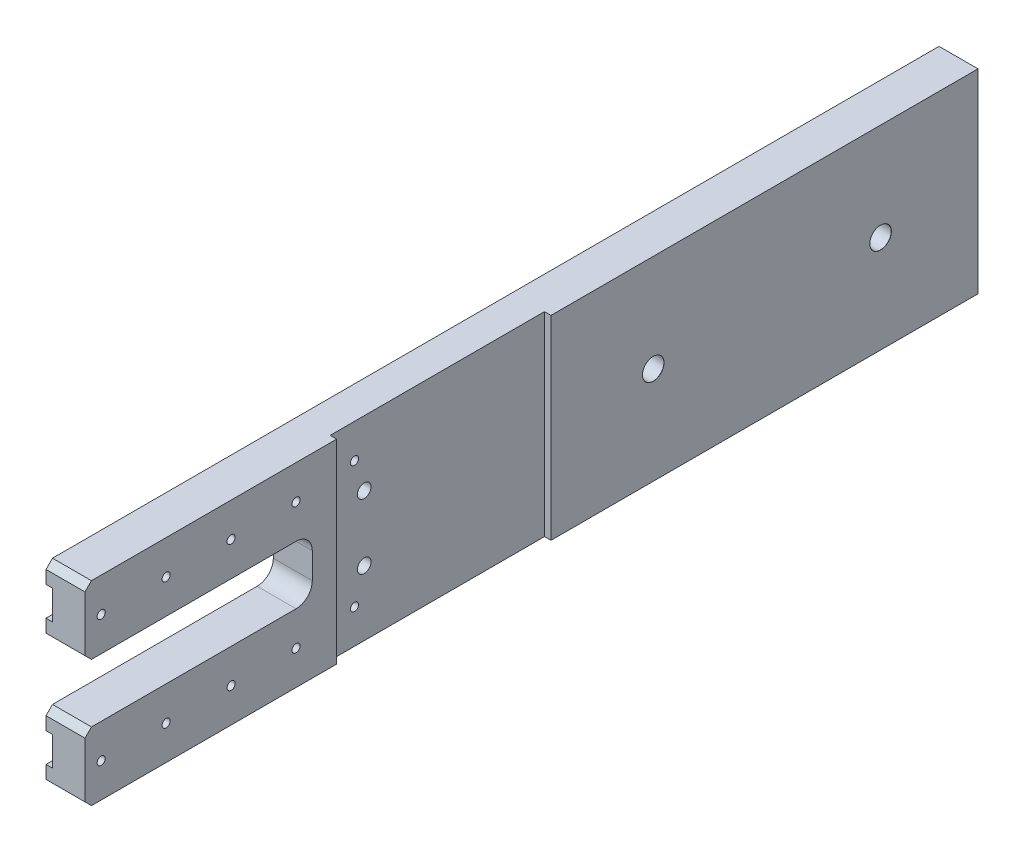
ISO-10303-21;
HEADER;
FILE_DESCRIPTION(('STEP AP214'),'2;1');
FILE_NAME('part.step','',(''),(''),'','','');
FILE_SCHEMA(('AUTOMOTIVE_DESIGN { 1 0 10303 214 1 1 1 1 }'));
ENDSEC;
DATA;
#1=APPLICATION_CONTEXT('core data for automotive mechanical design processes');
#2=APPLICATION_PROTOCOL_DEFINITION('international standard','automotive_design',2000,#1);
#3=PRODUCT_CONTEXT('',#1,'mechanical');
#4=PRODUCT('Part','Part','',(#3));
#5=PRODUCT_RELATED_PRODUCT_CATEGORY('part','',(#4));
#6=PRODUCT_DEFINITION_FORMATION('','',#4);
#7=PRODUCT_DEFINITION_CONTEXT('part definition',#1,'design');
#8=PRODUCT_DEFINITION('design','',#6,#7);
#9=PRODUCT_DEFINITION_SHAPE('','',#8);
#10=(LENGTH_UNIT() NAMED_UNIT(*) SI_UNIT(.MILLI.,.METRE.));
#11=(NAMED_UNIT(*) PLANE_ANGLE_UNIT() SI_UNIT($,.RADIAN.));
#12=(NAMED_UNIT(*) SI_UNIT($,.STERADIAN.) SOLID_ANGLE_UNIT());
#13=UNCERTAINTY_MEASURE_WITH_UNIT(LENGTH_MEASURE(1.E-05),#10,'distance_accuracy_value','');
#14=(GEOMETRIC_REPRESENTATION_CONTEXT(3) GLOBAL_UNCERTAINTY_ASSIGNED_CONTEXT((#13)) GLOBAL_UNIT_ASSIGNED_CONTEXT((#10,
#11,#12)) REPRESENTATION_CONTEXT('',''));
#15=CARTESIAN_POINT('',(0.,0.,0.));
#16=DIRECTION('',(0.,0.,1.));
#17=DIRECTION('',(1.,0.,0.));
#18=AXIS2_PLACEMENT_3D('',#15,#16,#17);
#19=CARTESIAN_POINT('',(60.,-34.,275.));
#20=DIRECTION('',(-1.,0.,0.));
#21=DIRECTION('',(0.,0.,1.));
#22=AXIS2_PLACEMENT_3D('',#19,#20,#21);
#23=PLANE('',#22);
#24=CARTESIAN_POINT('',(60.,-83.5000000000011,270.));
#25=DIRECTION('',(-1.,0.,0.));
#26=DIRECTION('',(0.,0.,1.));
#27=AXIS2_PLACEMENT_3D('',#24,#25,#26);
#28=CIRCLE('',#27,1.25);
#29=CARTESIAN_POINT('',(60.,-83.5000000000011,271.25));
#30=VERTEX_POINT('',#29);
#31=EDGE_CURVE('E470',#30,#30,#28,.T.);
#32=ORIENTED_EDGE('',*,*,#31,.T.);
#33=EDGE_LOOP('',(#32));
#34=FACE_BOUND('',#33,.T.);
#35=CARTESIAN_POINT('',(60.,-83.5000000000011,250.));
#36=DIRECTION('',(-1.,0.,0.));
#37=DIRECTION('',(0.,0.,1.));
#38=AXIS2_PLACEMENT_3D('',#35,#36,#37);
#39=CIRCLE('',#38,1.25);
#40=CARTESIAN_POINT('',(60.,-83.5000000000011,251.25));
#41=VERTEX_POINT('',#40);
#42=EDGE_CURVE('E464',#41,#41,#39,.T.);
#43=ORIENTED_EDGE('',*,*,#42,.T.);
#44=EDGE_LOOP('',(#43));
#45=FACE_BOUND('',#44,.T.);
#46=CARTESIAN_POINT('',(60.,-83.5000000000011,230.));
#47=DIRECTION('',(-1.,0.,0.));
#48=DIRECTION('',(0.,0.,1.));
#49=AXIS2_PLACEMENT_3D('',#46,#47,#48);
#50=CIRCLE('',#49,1.25);
#51=CARTESIAN_POINT('',(60.,-83.5000000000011,231.25));
#52=VERTEX_POINT('',#51);
#53=EDGE_CURVE('E458',#52,#52,#50,.T.);
#54=ORIENTED_EDGE('',*,*,#53,.T.);
#55=EDGE_LOOP('',(#54));
#56=FACE_BOUND('',#55,.T.);
#57=CARTESIAN_POINT('',(60.,-83.5000000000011,210.));
#58=DIRECTION('',(-1.,0.,0.));
#59=DIRECTION('',(0.,0.,1.));
#60=AXIS2_PLACEMENT_3D('',#57,#58,#59);
#61=CIRCLE('',#60,1.25);
#62=CARTESIAN_POINT('',(60.,-83.5000000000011,211.25));
#63=VERTEX_POINT('',#62);
#64=EDGE_CURVE('E452',#63,#63,#61,.T.);
#65=ORIENTED_EDGE('',*,*,#64,.T.);
#66=EDGE_LOOP('',(#65));
#67=FACE_BOUND('',#66,.T.);
#68=CARTESIAN_POINT('',(60.,-44.5000000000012,210.));
#69=DIRECTION('',(-1.,0.,0.));
#70=DIRECTION('',(0.,0.,1.));
#71=AXIS2_PLACEMENT_3D('',#68,#69,#70);
#72=CIRCLE('',#71,1.25);
#73=CARTESIAN_POINT('',(60.,-44.5000000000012,211.25));
#74=VERTEX_POINT('',#73);
#75=EDGE_CURVE('E440',#74,#74,#72,.T.);
#76=ORIENTED_EDGE('',*,*,#75,.T.);
#77=EDGE_LOOP('',(#76));
#78=FACE_BOUND('',#77,.T.);
#79=CARTESIAN_POINT('',(60.,-44.5000000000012,230.));
#80=DIRECTION('',(-1.,0.,0.));
#81=DIRECTION('',(0.,0.,1.));
#82=AXIS2_PLACEMENT_3D('',#79,#80,#81);
#83=CIRCLE('',#82,1.25);
#84=CARTESIAN_POINT('',(60.,-44.5000000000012,231.25));
#85=VERTEX_POINT('',#84);
#86=EDGE_CURVE('E434',#85,#85,#83,.T.);
#87=ORIENTED_EDGE('',*,*,#86,.T.);
#88=EDGE_LOOP('',(#87));
#89=FACE_BOUND('',#88,.T.);
#90=CARTESIAN_POINT('',(60.,-44.5000000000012,250.));
#91=DIRECTION('',(-1.,0.,0.));
#92=DIRECTION('',(0.,0.,1.));
#93=AXIS2_PLACEMENT_3D('',#90,#91,#92);
#94=CIRCLE('',#93,1.25);
#95=CARTESIAN_POINT('',(60.,-44.5000000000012,251.25));
#96=VERTEX_POINT('',#95);
#97=EDGE_CURVE('E428',#96,#96,#94,.T.);
#98=ORIENTED_EDGE('',*,*,#97,.T.);
#99=EDGE_LOOP('',(#98));
#100=FACE_BOUND('',#99,.T.);
#101=CARTESIAN_POINT('',(60.,-44.5000000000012,270.));
#102=DIRECTION('',(-1.,0.,0.));
#103=DIRECTION('',(0.,0.,1.));
#104=AXIS2_PLACEMENT_3D('',#101,#102,#103);
#105=CIRCLE('',#104,1.25);
#106=CARTESIAN_POINT('',(60.,-44.5000000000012,271.25));
#107=VERTEX_POINT('',#106);
#108=EDGE_CURVE('E422',#107,#107,#105,.T.);
#109=ORIENTED_EDGE('',*,*,#108,.T.);
#110=EDGE_LOOP('',(#109));
#111=FACE_BOUND('',#110,.T.);
#112=DIRECTION('',(0.,0.,-1.));
#113=VECTOR('',#112,1.);
#114=CARTESIAN_POINT('',(60.,-94.,275.));
#115=LINE('',#114,#113);
#116=CARTESIAN_POINT('',(60.,-94.,273.));
#117=VERTEX_POINT('',#116);
#118=CARTESIAN_POINT('',(60.,-94.,197.5));
#119=VERTEX_POINT('',#118);
#120=EDGE_CURVE('E219',#117,#119,#115,.T.);
#121=ORIENTED_EDGE('',*,*,#120,.T.);
#122=DIRECTION('',(0.,1.,0.));
#123=VECTOR('',#122,1.);
#124=CARTESIAN_POINT('',(60.,-94.,197.5));
#125=LINE('',#124,#123);
#126=CARTESIAN_POINT('',(60.,-34.,197.5));
#127=VERTEX_POINT('',#126);
#128=EDGE_CURVE('E399',#119,#127,#125,.T.);
#129=ORIENTED_EDGE('',*,*,#128,.T.);
#130=DIRECTION('',(0.,0.,-1.));
#131=VECTOR('',#130,1.);
#132=CARTESIAN_POINT('',(60.,-34.,275.));
#133=LINE('',#132,#131);
#134=CARTESIAN_POINT('',(60.,-34.,273.));
#135=VERTEX_POINT('',#134);
#136=EDGE_CURVE('E220',#135,#127,#133,.T.);
#137=ORIENTED_EDGE('',*,*,#136,.F.);
#138=DIRECTION('',(0.,-0.707106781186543,0.707106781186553));
#139=VECTOR('',#138,1.);
#140=CARTESIAN_POINT('',(60.,-36.,275.));
#141=LINE('',#140,#139);
#142=CARTESIAN_POINT('',(60.,-36.,275.));
#143=VERTEX_POINT('',#142);
#144=EDGE_CURVE('E244',#135,#143,#141,.T.);
#145=ORIENTED_EDGE('',*,*,#144,.T.);
#146=DIRECTION('',(0.,1.,0.));
#147=VECTOR('',#146,1.);
#148=CARTESIAN_POINT('',(60.,-34.,275.));
#149=LINE('',#148,#147);
#150=CARTESIAN_POINT('',(60.,-53.,275.));
#151=VERTEX_POINT('',#150);
#152=EDGE_CURVE('E305',#151,#143,#149,.T.);
#153=ORIENTED_EDGE('',*,*,#152,.F.);
#154=DIRECTION('',(0.,-0.707106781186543,-0.707106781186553));
#155=VECTOR('',#154,1.);
#156=CARTESIAN_POINT('',(60.,-55.,273.));
#157=LINE('',#156,#155);
#158=CARTESIAN_POINT('',(60.,-55.,273.));
#159=VERTEX_POINT('',#158);
#160=EDGE_CURVE('E242',#151,#159,#157,.T.);
#161=ORIENTED_EDGE('',*,*,#160,.T.);
#162=DIRECTION('',(0.,0.,-1.));
#163=VECTOR('',#162,1.);
#164=CARTESIAN_POINT('',(60.,-55.,275.));
#165=LINE('',#164,#163);
#166=CARTESIAN_POINT('',(60.,-55.,210.));
#167=VERTEX_POINT('',#166);
#168=EDGE_CURVE('E534',#159,#167,#165,.T.);
#169=ORIENTED_EDGE('',*,*,#168,.T.);
#170=CARTESIAN_POINT('',(60.,-60.,210.));
#171=DIRECTION('',(-1.,0.,0.));
#172=DIRECTION('',(0.,0.,-1.));
#173=AXIS2_PLACEMENT_3D('',#170,#171,#172);
#174=CIRCLE('',#173,5.);
#175=CARTESIAN_POINT('',(60.,-60.,205.));
#176=VERTEX_POINT('',#175);
#177=EDGE_CURVE('E536',#167,#176,#174,.T.);
#178=ORIENTED_EDGE('',*,*,#177,.T.);
#179=DIRECTION('',(0.,-1.,0.));
#180=VECTOR('',#179,1.);
#181=CARTESIAN_POINT('',(60.,-60.,205.));
#182=LINE('',#181,#180);
#183=CARTESIAN_POINT('',(60.,-68.,205.));
#184=VERTEX_POINT('',#183);
#185=EDGE_CURVE('E539',#176,#184,#182,.T.);
#186=ORIENTED_EDGE('',*,*,#185,.T.);
#187=CARTESIAN_POINT('',(60.,-68.,210.));
#188=DIRECTION('',(-1.,0.,0.));
#189=DIRECTION('',(0.,0.,-1.));
#190=AXIS2_PLACEMENT_3D('',#187,#188,#189);
#191=CIRCLE('',#190,5.);
#192=CARTESIAN_POINT('',(60.,-73.,210.));
#193=VERTEX_POINT('',#192);
#194=EDGE_CURVE('E278',#184,#193,#191,.T.);
#195=ORIENTED_EDGE('',*,*,#194,.T.);
#196=DIRECTION('',(0.,0.,1.));
#197=VECTOR('',#196,1.);
#198=CARTESIAN_POINT('',(60.,-73.,275.));
#199=LINE('',#198,#197);
#200=CARTESIAN_POINT('',(60.,-73.,273.));
#201=VERTEX_POINT('',#200);
#202=EDGE_CURVE('E267',#193,#201,#199,.T.);
#203=ORIENTED_EDGE('',*,*,#202,.T.);
#204=DIRECTION('',(0.,-0.707106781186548,0.707106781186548));
#205=VECTOR('',#204,1.);
#206=CARTESIAN_POINT('',(60.,-75.,275.));
#207=LINE('',#206,#205);
#208=CARTESIAN_POINT('',(60.,-75.,275.));
#209=VERTEX_POINT('',#208);
#210=EDGE_CURVE('E240',#201,#209,#207,.T.);
#211=ORIENTED_EDGE('',*,*,#210,.T.);
#212=CARTESIAN_POINT('',(60.,-92.,275.));
#213=VERTEX_POINT('',#212);
#214=EDGE_CURVE('E289',#213,#209,#149,.T.);
#215=ORIENTED_EDGE('',*,*,#214,.F.);
#216=DIRECTION('',(0.,-0.707106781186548,-0.707106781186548));
#217=VECTOR('',#216,1.);
#218=CARTESIAN_POINT('',(60.,-92.,275.));
#219=LINE('',#218,#217);
#220=EDGE_CURVE('E238',#213,#117,#219,.T.);
#221=ORIENTED_EDGE('',*,*,#220,.T.);
#222=EDGE_LOOP('',(#121,#129,#137,#145,#153,#161,#169,#178,#186,#195,#203,#211,#215,#221));
#223=FACE_BOUND('',#222,.T.);
#224=ADVANCED_FACE('F16',(#34,#45,#56,#67,#78,#89,#100,#111,#223),#23,.F.);
#225=CARTESIAN_POINT('',(0.,0.,275.));
#226=DIRECTION('',(0.,0.,1.));
#227=DIRECTION('',(1.,0.,0.));
#228=AXIS2_PLACEMENT_3D('',#225,#226,#227);
#229=PLANE('',#228);
#230=ORIENTED_EDGE('',*,*,#214,.T.);
#231=DIRECTION('',(-1.,0.,0.));
#232=VECTOR('',#231,1.);
#233=CARTESIAN_POINT('',(48.,-75.,275.));
#234=LINE('',#233,#232);
#235=CARTESIAN_POINT('',(48.,-75.,275.));
#236=VERTEX_POINT('',#235);
#237=EDGE_CURVE('E256',#209,#236,#234,.T.);
#238=ORIENTED_EDGE('',*,*,#237,.T.);
#239=DIRECTION('',(0.,-1.,0.));
#240=VECTOR('',#239,1.);
#241=CARTESIAN_POINT('',(48.,-34.,275.));
#242=LINE('',#241,#240);
#243=CARTESIAN_POINT('',(48.,-79.,275.));
#244=VERTEX_POINT('',#243);
#245=EDGE_CURVE('E287',#236,#244,#242,.T.);
#246=ORIENTED_EDGE('',*,*,#245,.T.);
#247=DIRECTION('',(-1.,0.,0.));
#248=VECTOR('',#247,1.);
#249=CARTESIAN_POINT('',(48.,-79.,275.));
#250=LINE('',#249,#248);
#251=CARTESIAN_POINT('',(50.,-79.,275.));
#252=VERTEX_POINT('',#251);
#253=EDGE_CURVE('E356',#252,#244,#250,.T.);
#254=ORIENTED_EDGE('',*,*,#253,.F.);
#255=DIRECTION('',(0.,1.,0.));
#256=VECTOR('',#255,1.);
#257=CARTESIAN_POINT('',(50.,-79.,275.));
#258=LINE('',#257,#256);
#259=CARTESIAN_POINT('',(50.,-88.,275.));
#260=VERTEX_POINT('',#259);
#261=EDGE_CURVE('E365',#260,#252,#258,.T.);
#262=ORIENTED_EDGE('',*,*,#261,.F.);
#263=DIRECTION('',(1.,0.,0.));
#264=VECTOR('',#263,1.);
#265=CARTESIAN_POINT('',(48.,-88.,275.));
#266=LINE('',#265,#264);
#267=CARTESIAN_POINT('',(48.,-88.,275.));
#268=VERTEX_POINT('',#267);
#269=EDGE_CURVE('E345',#268,#260,#266,.T.);
#270=ORIENTED_EDGE('',*,*,#269,.F.);
#271=CARTESIAN_POINT('',(48.,-92.,275.));
#272=VERTEX_POINT('',#271);
#273=EDGE_CURVE('E297',#268,#272,#242,.T.);
#274=ORIENTED_EDGE('',*,*,#273,.T.);
#275=DIRECTION('',(1.,0.,0.));
#276=VECTOR('',#275,1.);
#277=CARTESIAN_POINT('',(60.,-92.,275.));
#278=LINE('',#277,#276);
#279=EDGE_CURVE('E253',#272,#213,#278,.T.);
#280=ORIENTED_EDGE('',*,*,#279,.T.);
#281=EDGE_LOOP('',(#230,#238,#246,#254,#262,#270,#274,#280));
#282=FACE_BOUND('',#281,.T.);
#283=ADVANCED_FACE('F285',(#282),#229,.T.);
#284=CARTESIAN_POINT('',(48.,-34.,275.));
#285=DIRECTION('',(1.,0.,0.));
#286=DIRECTION('',(0.,0.,-1.));
#287=AXIS2_PLACEMENT_3D('',#284,#285,#286);
#288=PLANE('',#287);
#289=CARTESIAN_POINT('',(48.,-74.,187.));
#290=DIRECTION('',(1.,0.,0.));
#291=DIRECTION('',(0.,0.,-1.));
#292=AXIS2_PLACEMENT_3D('',#289,#290,#291);
#293=CIRCLE('',#292,2.1);
#294=CARTESIAN_POINT('',(48.,-74.,184.9));
#295=VERTEX_POINT('',#294);
#296=EDGE_CURVE('E413',#295,#295,#293,.T.);
#297=ORIENTED_EDGE('',*,*,#296,.T.);
#298=EDGE_LOOP('',(#297));
#299=FACE_BOUND('',#298,.T.);
#300=CARTESIAN_POINT('',(48.,-54.,187.));
#301=DIRECTION('',(1.,0.,0.));
#302=DIRECTION('',(0.,0.,-1.));
#303=AXIS2_PLACEMENT_3D('',#300,#301,#302);
#304=CIRCLE('',#303,2.1);
#305=CARTESIAN_POINT('',(48.,-54.,184.9));
#306=VERTEX_POINT('',#305);
#307=EDGE_CURVE('E416',#306,#306,#304,.T.);
#308=ORIENTED_EDGE('',*,*,#307,.T.);
#309=EDGE_LOOP('',(#308));
#310=FACE_BOUND('',#309,.T.);
#311=CARTESIAN_POINT('',(48.,-64.,30.));
#312=DIRECTION('',(-1.,0.,0.));
#313=DIRECTION('',(0.,0.,1.));
#314=AXIS2_PLACEMENT_3D('',#311,#312,#313);
#315=CIRCLE('',#314,5.525);
#316=CARTESIAN_POINT('',(48.,-64.,35.525));
#317=VERTEX_POINT('',#316);
#318=EDGE_CURVE('E476',#317,#317,#315,.T.);
#319=ORIENTED_EDGE('',*,*,#318,.F.);
#320=EDGE_LOOP('',(#319));
#321=FACE_BOUND('',#320,.T.);
#322=CARTESIAN_POINT('',(48.,-64.,100.));
#323=DIRECTION('',(-1.,0.,0.));
#324=DIRECTION('',(0.,0.,1.));
#325=AXIS2_PLACEMENT_3D('',#322,#323,#324);
#326=CIRCLE('',#325,5.525);
#327=CARTESIAN_POINT('',(48.,-64.,105.525));
#328=VERTEX_POINT('',#327);
#329=EDGE_CURVE('E497',#328,#328,#326,.T.);
#330=ORIENTED_EDGE('',*,*,#329,.F.);
#331=EDGE_LOOP('',(#330));
#332=FACE_BOUND('',#331,.T.);
#333=DIRECTION('',(0.,0.,-1.));
#334=VECTOR('',#333,1.);
#335=CARTESIAN_POINT('',(48.,-55.,275.));
#336=LINE('',#335,#334);
#337=CARTESIAN_POINT('',(48.,-55.,273.));
#338=VERTEX_POINT('',#337);
#339=CARTESIAN_POINT('',(48.,-55.,210.));
#340=VERTEX_POINT('',#339);
#341=EDGE_CURVE('E533',#338,#340,#336,.T.);
#342=ORIENTED_EDGE('',*,*,#341,.F.);
#343=DIRECTION('',(0.,0.707106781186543,0.707106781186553));
#344=VECTOR('',#343,1.);
#345=CARTESIAN_POINT('',(48.,-55.,273.));
#346=LINE('',#345,#344);
#347=CARTESIAN_POINT('',(48.,-53.,275.));
#348=VERTEX_POINT('',#347);
#349=EDGE_CURVE('E251',#338,#348,#346,.T.);
#350=ORIENTED_EDGE('',*,*,#349,.T.);
#351=CARTESIAN_POINT('',(48.,-49.,275.));
#352=VERTEX_POINT('',#351);
#353=EDGE_CURVE('E296',#352,#348,#242,.T.);
#354=ORIENTED_EDGE('',*,*,#353,.F.);
#355=DIRECTION('',(0.,0.,1.));
#356=VECTOR('',#355,1.);
#357=CARTESIAN_POINT('',(48.,-49.,0.));
#358=LINE('',#357,#356);
#359=CARTESIAN_POINT('',(48.,-49.,0.));
#360=VERTEX_POINT('',#359);
#361=EDGE_CURVE('E342',#360,#352,#358,.T.);
#362=ORIENTED_EDGE('',*,*,#361,.F.);
#363=DIRECTION('',(0.,-1.,0.));
#364=VECTOR('',#363,1.);
#365=CARTESIAN_POINT('',(48.,-34.,0.));
#366=LINE('',#365,#364);
#367=CARTESIAN_POINT('',(48.,-79.,0.));
#368=VERTEX_POINT('',#367);
#369=EDGE_CURVE('E318',#360,#368,#366,.T.);
#370=ORIENTED_EDGE('',*,*,#369,.T.);
#371=DIRECTION('',(0.,0.,1.));
#372=VECTOR('',#371,1.);
#373=CARTESIAN_POINT('',(48.,-79.,0.));
#374=LINE('',#373,#372);
#375=EDGE_CURVE('E295',#368,#244,#374,.T.);
#376=ORIENTED_EDGE('',*,*,#375,.T.);
#377=ORIENTED_EDGE('',*,*,#245,.F.);
#378=DIRECTION('',(0.,0.707106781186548,-0.707106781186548));
#379=VECTOR('',#378,1.);
#380=CARTESIAN_POINT('',(48.,-75.,275.));
#381=LINE('',#380,#379);
#382=CARTESIAN_POINT('',(48.,-73.,273.));
#383=VERTEX_POINT('',#382);
#384=EDGE_CURVE('E249',#236,#383,#381,.T.);
#385=ORIENTED_EDGE('',*,*,#384,.T.);
#386=DIRECTION('',(0.,0.,1.));
#387=VECTOR('',#386,1.);
#388=CARTESIAN_POINT('',(48.,-73.,275.));
#389=LINE('',#388,#387);
#390=CARTESIAN_POINT('',(48.,-73.,210.));
#391=VERTEX_POINT('',#390);
#392=EDGE_CURVE('E270',#391,#383,#389,.T.);
#393=ORIENTED_EDGE('',*,*,#392,.F.);
#394=CARTESIAN_POINT('',(48.,-68.,210.));
#395=DIRECTION('',(-1.,0.,0.));
#396=DIRECTION('',(0.,0.,-1.));
#397=AXIS2_PLACEMENT_3D('',#394,#395,#396);
#398=CIRCLE('',#397,5.);
#399=CARTESIAN_POINT('',(48.,-68.,205.));
#400=VERTEX_POINT('',#399);
#401=EDGE_CURVE('E549',#400,#391,#398,.T.);
#402=ORIENTED_EDGE('',*,*,#401,.F.);
#403=DIRECTION('',(0.,-1.,0.));
#404=VECTOR('',#403,1.);
#405=CARTESIAN_POINT('',(48.,-60.,205.));
#406=LINE('',#405,#404);
#407=CARTESIAN_POINT('',(48.,-60.,205.));
#408=VERTEX_POINT('',#407);
#409=EDGE_CURVE('E546',#408,#400,#406,.T.);
#410=ORIENTED_EDGE('',*,*,#409,.F.);
#411=CARTESIAN_POINT('',(48.,-60.,210.));
#412=DIRECTION('',(-1.,0.,0.));
#413=DIRECTION('',(0.,0.,-1.));
#414=AXIS2_PLACEMENT_3D('',#411,#412,#413);
#415=CIRCLE('',#414,5.);
#416=EDGE_CURVE('E543',#340,#408,#415,.T.);
#417=ORIENTED_EDGE('',*,*,#416,.F.);
#418=EDGE_LOOP('',(#342,#350,#354,#362,#370,#376,#377,#385,#393,#402,#410,#417));
#419=FACE_BOUND('',#418,.T.);
#420=ADVANCED_FACE('F293',(#299,#310,#321,#332,#419),#288,.F.);
#421=CARTESIAN_POINT('',(48.,-36.,275.));
#422=VERTEX_POINT('',#421);
#423=CARTESIAN_POINT('',(48.,-40.,275.));
#424=VERTEX_POINT('',#423);
#425=EDGE_CURVE('E299',#422,#424,#242,.T.);
#426=ORIENTED_EDGE('',*,*,#425,.F.);
#427=DIRECTION('',(0.,0.707106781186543,-0.707106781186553));
#428=VECTOR('',#427,1.);
#429=CARTESIAN_POINT('',(48.,-36.,275.));
#430=LINE('',#429,#428);
#431=CARTESIAN_POINT('',(48.,-34.,273.));
#432=VERTEX_POINT('',#431);
#433=EDGE_CURVE('E234',#422,#432,#430,.T.);
#434=ORIENTED_EDGE('',*,*,#433,.T.);
#435=DIRECTION('',(0.,0.,-1.));
#436=VECTOR('',#435,1.);
#437=CARTESIAN_POINT('',(48.,-34.,275.));
#438=LINE('',#437,#436);
#439=CARTESIAN_POINT('',(48.,-34.,0.));
#440=VERTEX_POINT('',#439);
#441=EDGE_CURVE('E313',#432,#440,#438,.T.);
#442=ORIENTED_EDGE('',*,*,#441,.T.);
#443=CARTESIAN_POINT('',(48.,-40.,0.));
#444=VERTEX_POINT('',#443);
#445=EDGE_CURVE('E315',#440,#444,#366,.T.);
#446=ORIENTED_EDGE('',*,*,#445,.T.);
#447=DIRECTION('',(0.,0.,1.));
#448=VECTOR('',#447,1.);
#449=CARTESIAN_POINT('',(48.,-40.,0.));
#450=LINE('',#449,#448);
#451=EDGE_CURVE('E340',#444,#424,#450,.T.);
#452=ORIENTED_EDGE('',*,*,#451,.T.);
#453=EDGE_LOOP('',(#426,#434,#442,#446,#452));
#454=FACE_BOUND('',#453,.T.);
#455=ADVANCED_FACE('F339',(#454),#288,.F.);
#456=DIRECTION('',(0.,0.,-1.));
#457=VECTOR('',#456,1.);
#458=CARTESIAN_POINT('',(48.,-94.,275.));
#459=LINE('',#458,#457);
#460=CARTESIAN_POINT('',(48.,-94.,273.));
#461=VERTEX_POINT('',#460);
#462=CARTESIAN_POINT('',(48.,-94.,0.));
#463=VERTEX_POINT('',#462);
#464=EDGE_CURVE('E223',#461,#463,#459,.T.);
#465=ORIENTED_EDGE('',*,*,#464,.F.);
#466=DIRECTION('',(0.,0.707106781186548,0.707106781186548));
#467=VECTOR('',#466,1.);
#468=CARTESIAN_POINT('',(48.,-92.,275.));
#469=LINE('',#468,#467);
#470=EDGE_CURVE('E11',#461,#272,#469,.T.);
#471=ORIENTED_EDGE('',*,*,#470,.T.);
#472=ORIENTED_EDGE('',*,*,#273,.F.);
#473=DIRECTION('',(0.,0.,1.));
#474=VECTOR('',#473,1.);
#475=CARTESIAN_POINT('',(48.,-88.,0.));
#476=LINE('',#475,#474);
#477=CARTESIAN_POINT('',(48.,-88.,0.));
#478=VERTEX_POINT('',#477);
#479=EDGE_CURVE('E362',#478,#268,#476,.T.);
#480=ORIENTED_EDGE('',*,*,#479,.F.);
#481=EDGE_CURVE('E319',#478,#463,#366,.T.);
#482=ORIENTED_EDGE('',*,*,#481,.T.);
#483=EDGE_LOOP('',(#465,#471,#472,#480,#482));
#484=FACE_BOUND('',#483,.T.);
#485=ADVANCED_FACE('F384',(#484),#288,.F.);
#486=CARTESIAN_POINT('',(48.,-94.,275.));
#487=DIRECTION('',(0.,1.,0.));
#488=DIRECTION('',(0.,0.,1.));
#489=AXIS2_PLACEMENT_3D('',#486,#487,#488);
#490=PLANE('',#489);
#491=DIRECTION('',(0.,0.,1.));
#492=VECTOR('',#491,1.);
#493=CARTESIAN_POINT('',(58.,-94.,197.5));
#494=LINE('',#493,#492);
#495=CARTESIAN_POINT('',(58.,-94.,131.5));
#496=VERTEX_POINT('',#495);
#497=CARTESIAN_POINT('',(58.,-94.,197.5));
#498=VERTEX_POINT('',#497);
#499=EDGE_CURVE('E203',#496,#498,#494,.T.);
#500=ORIENTED_EDGE('',*,*,#499,.T.);
#501=DIRECTION('',(1.,0.,0.));
#502=VECTOR('',#501,1.);
#503=CARTESIAN_POINT('',(60.,-94.,197.5));
#504=LINE('',#503,#502);
#505=EDGE_CURVE('E213',#498,#119,#504,.T.);
#506=ORIENTED_EDGE('',*,*,#505,.T.);
#507=ORIENTED_EDGE('',*,*,#120,.F.);
#508=DIRECTION('',(-1.,0.,0.));
#509=VECTOR('',#508,1.);
#510=CARTESIAN_POINT('',(48.,-94.,273.));
#511=LINE('',#510,#509);
#512=EDGE_CURVE('E25',#117,#461,#511,.T.);
#513=ORIENTED_EDGE('',*,*,#512,.T.);
#514=ORIENTED_EDGE('',*,*,#464,.T.);
#515=DIRECTION('',(1.,0.,0.));
#516=VECTOR('',#515,1.);
#517=CARTESIAN_POINT('',(48.,-94.,0.));
#518=LINE('',#517,#516);
#519=CARTESIAN_POINT('',(60.,-94.,0.));
#520=VERTEX_POINT('',#519);
#521=EDGE_CURVE('E217',#463,#520,#518,.T.);
#522=ORIENTED_EDGE('',*,*,#521,.T.);
#523=CARTESIAN_POINT('',(60.,-94.,131.5));
#524=VERTEX_POINT('',#523);
#525=EDGE_CURVE('E210',#524,#520,#115,.T.);
#526=ORIENTED_EDGE('',*,*,#525,.F.);
#527=DIRECTION('',(-1.,0.,0.));
#528=VECTOR('',#527,1.);
#529=CARTESIAN_POINT('',(60.,-94.,131.5));
#530=LINE('',#529,#528);
#531=EDGE_CURVE('E197',#524,#496,#530,.T.);
#532=ORIENTED_EDGE('',*,*,#531,.T.);
#533=EDGE_LOOP('',(#500,#506,#507,#513,#514,#522,#526,#532));
#534=FACE_BOUND('',#533,.T.);
#535=ADVANCED_FACE('F215',(#534),#490,.F.);
#536=CARTESIAN_POINT('',(60.,-64.,30.));
#537=DIRECTION('',(-1.,0.,0.));
#538=DIRECTION('',(0.,0.,1.));
#539=AXIS2_PLACEMENT_3D('',#536,#537,#538);
#540=CIRCLE('',#539,3.325);
#541=CARTESIAN_POINT('',(60.,-64.,33.325));
#542=VERTEX_POINT('',#541);
#543=EDGE_CURVE('E473',#542,#542,#540,.T.);
#544=ORIENTED_EDGE('',*,*,#543,.T.);
#545=EDGE_LOOP('',(#544));
#546=FACE_BOUND('',#545,.T.);
#547=CARTESIAN_POINT('',(60.,-64.,100.));
#548=DIRECTION('',(-1.,0.,0.));
#549=DIRECTION('',(0.,0.,1.));
#550=AXIS2_PLACEMENT_3D('',#547,#548,#549);
#551=CIRCLE('',#550,3.325);
#552=CARTESIAN_POINT('',(60.,-64.,103.325));
#553=VERTEX_POINT('',#552);
#554=EDGE_CURVE('E494',#553,#553,#551,.T.);
#555=ORIENTED_EDGE('',*,*,#554,.T.);
#556=EDGE_LOOP('',(#555));
#557=FACE_BOUND('',#556,.T.);
#558=CARTESIAN_POINT('',(60.,-34.,131.5));
#559=VERTEX_POINT('',#558);
#560=CARTESIAN_POINT('',(60.,-34.,0.));
#561=VERTEX_POINT('',#560);
#562=EDGE_CURVE('E212',#559,#561,#133,.T.);
#563=ORIENTED_EDGE('',*,*,#562,.F.);
#564=DIRECTION('',(0.,1.,0.));
#565=VECTOR('',#564,1.);
#566=CARTESIAN_POINT('',(60.,-94.,131.5));
#567=LINE('',#566,#565);
#568=EDGE_CURVE('E32',#524,#559,#567,.T.);
#569=ORIENTED_EDGE('',*,*,#568,.F.);
#570=ORIENTED_EDGE('',*,*,#525,.T.);
#571=DIRECTION('',(0.,1.,0.));
#572=VECTOR('',#571,1.);
#573=CARTESIAN_POINT('',(60.,-34.,0.));
#574=LINE('',#573,#572);
#575=EDGE_CURVE('E321',#520,#561,#574,.T.);
#576=ORIENTED_EDGE('',*,*,#575,.T.);
#577=EDGE_LOOP('',(#563,#569,#570,#576));
#578=FACE_BOUND('',#577,.T.);
#579=ADVANCED_FACE('F208',(#546,#557,#578),#23,.F.);
#580=CARTESIAN_POINT('',(48.,-34.,275.));
#581=DIRECTION('',(0.,-1.,0.));
#582=DIRECTION('',(0.,0.,-1.));
#583=AXIS2_PLACEMENT_3D('',#580,#581,#582);
#584=PLANE('',#583);
#585=ORIENTED_EDGE('',*,*,#136,.T.);
#586=DIRECTION('',(1.,0.,0.));
#587=VECTOR('',#586,1.);
#588=CARTESIAN_POINT('',(60.,-34.,197.5));
#589=LINE('',#588,#587);
#590=CARTESIAN_POINT('',(58.,-34.,197.5));
#591=VERTEX_POINT('',#590);
#592=EDGE_CURVE('E204',#591,#127,#589,.T.);
#593=ORIENTED_EDGE('',*,*,#592,.F.);
#594=DIRECTION('',(0.,0.,1.));
#595=VECTOR('',#594,1.);
#596=CARTESIAN_POINT('',(58.,-34.,197.5));
#597=LINE('',#596,#595);
#598=CARTESIAN_POINT('',(58.,-34.,131.5));
#599=VERTEX_POINT('',#598);
#600=EDGE_CURVE('E395',#599,#591,#597,.T.);
#601=ORIENTED_EDGE('',*,*,#600,.F.);
#602=DIRECTION('',(-1.,0.,0.));
#603=VECTOR('',#602,1.);
#604=CARTESIAN_POINT('',(60.,-34.,131.5));
#605=LINE('',#604,#603);
#606=EDGE_CURVE('E331',#559,#599,#605,.T.);
#607=ORIENTED_EDGE('',*,*,#606,.F.);
#608=ORIENTED_EDGE('',*,*,#562,.T.);
#609=DIRECTION('',(-1.,0.,0.));
#610=VECTOR('',#609,1.);
#611=CARTESIAN_POINT('',(48.,-34.,0.));
#612=LINE('',#611,#610);
#613=EDGE_CURVE('E302',#561,#440,#612,.T.);
#614=ORIENTED_EDGE('',*,*,#613,.T.);
#615=ORIENTED_EDGE('',*,*,#441,.F.);
#616=DIRECTION('',(1.,0.,0.));
#617=VECTOR('',#616,1.);
#618=CARTESIAN_POINT('',(60.,-34.,273.));
#619=LINE('',#618,#617);
#620=EDGE_CURVE('E236',#432,#135,#619,.T.);
#621=ORIENTED_EDGE('',*,*,#620,.T.);
#622=EDGE_LOOP('',(#585,#593,#601,#607,#608,#614,#615,#621));
#623=FACE_BOUND('',#622,.T.);
#624=ADVANCED_FACE('F327',(#623),#584,.F.);
#625=ORIENTED_EDGE('',*,*,#152,.T.);
#626=DIRECTION('',(-1.,0.,0.));
#627=VECTOR('',#626,1.);
#628=CARTESIAN_POINT('',(48.,-36.,275.));
#629=LINE('',#628,#627);
#630=EDGE_CURVE('E231',#143,#422,#629,.T.);
#631=ORIENTED_EDGE('',*,*,#630,.T.);
#632=ORIENTED_EDGE('',*,*,#425,.T.);
#633=DIRECTION('',(-1.,0.,0.));
#634=VECTOR('',#633,1.);
#635=CARTESIAN_POINT('',(48.,-40.,275.));
#636=LINE('',#635,#634);
#637=CARTESIAN_POINT('',(50.,-40.,275.));
#638=VERTEX_POINT('',#637);
#639=EDGE_CURVE('E566',#638,#424,#636,.T.);
#640=ORIENTED_EDGE('',*,*,#639,.F.);
#641=DIRECTION('',(0.,1.,0.));
#642=VECTOR('',#641,1.);
#643=CARTESIAN_POINT('',(50.,-49.,275.));
#644=LINE('',#643,#642);
#645=CARTESIAN_POINT('',(50.,-49.,275.));
#646=VERTEX_POINT('',#645);
#647=EDGE_CURVE('E571',#646,#638,#644,.T.);
#648=ORIENTED_EDGE('',*,*,#647,.F.);
#649=DIRECTION('',(1.,0.,0.));
#650=VECTOR('',#649,1.);
#651=CARTESIAN_POINT('',(48.,-49.,275.));
#652=LINE('',#651,#650);
#653=EDGE_CURVE('E555',#352,#646,#652,.T.);
#654=ORIENTED_EDGE('',*,*,#653,.F.);
#655=ORIENTED_EDGE('',*,*,#353,.T.);
#656=DIRECTION('',(1.,0.,0.));
#657=VECTOR('',#656,1.);
#658=CARTESIAN_POINT('',(60.,-53.,275.));
#659=LINE('',#658,#657);
#660=EDGE_CURVE('E229',#348,#151,#659,.T.);
#661=ORIENTED_EDGE('',*,*,#660,.T.);
#662=EDGE_LOOP('',(#625,#631,#632,#640,#648,#654,#655,#661));
#663=FACE_BOUND('',#662,.T.);
#664=ADVANCED_FACE('F576',(#663),#229,.T.);
#665=CARTESIAN_POINT('',(0.,0.,0.));
#666=DIRECTION('',(0.,0.,1.));
#667=DIRECTION('',(1.,0.,0.));
#668=AXIS2_PLACEMENT_3D('',#665,#666,#667);
#669=PLANE('',#668);
#670=CARTESIAN_POINT('',(53.9093619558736,-42.,0.));
#671=DIRECTION('',(0.,0.,-1.));
#672=DIRECTION('',(-1.,0.,0.));
#673=AXIS2_PLACEMENT_3D('',#670,#671,#672);
#674=CIRCLE('',#673,2.5);
#675=CARTESIAN_POINT('',(51.4093619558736,-42.,0.));
#676=VERTEX_POINT('',#675);
#677=EDGE_CURVE('E515',#676,#676,#674,.T.);
#678=ORIENTED_EDGE('',*,*,#677,.F.);
#679=EDGE_LOOP('',(#678));
#680=FACE_BOUND('',#679,.T.);
#681=CARTESIAN_POINT('',(53.9093619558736,-64.,0.));
#682=DIRECTION('',(0.,0.,-1.));
#683=DIRECTION('',(-1.,0.,0.));
#684=AXIS2_PLACEMENT_3D('',#681,#682,#683);
#685=CIRCLE('',#684,2.5);
#686=CARTESIAN_POINT('',(51.4093619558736,-64.,0.));
#687=VERTEX_POINT('',#686);
#688=EDGE_CURVE('E521',#687,#687,#685,.T.);
#689=ORIENTED_EDGE('',*,*,#688,.F.);
#690=EDGE_LOOP('',(#689));
#691=FACE_BOUND('',#690,.T.);
#692=CARTESIAN_POINT('',(53.9093619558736,-86.,0.));
#693=DIRECTION('',(0.,0.,-1.));
#694=DIRECTION('',(-1.,0.,0.));
#695=AXIS2_PLACEMENT_3D('',#692,#693,#694);
#696=CIRCLE('',#695,2.5);
#697=CARTESIAN_POINT('',(51.4093619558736,-86.,0.));
#698=VERTEX_POINT('',#697);
#699=EDGE_CURVE('E527',#698,#698,#696,.T.);
#700=ORIENTED_EDGE('',*,*,#699,.F.);
#701=EDGE_LOOP('',(#700));
#702=FACE_BOUND('',#701,.T.);
#703=ORIENTED_EDGE('',*,*,#369,.F.);
#704=DIRECTION('',(1.,0.,0.));
#705=VECTOR('',#704,1.);
#706=CARTESIAN_POINT('',(48.,-49.,0.));
#707=LINE('',#706,#705);
#708=CARTESIAN_POINT('',(50.,-49.,0.));
#709=VERTEX_POINT('',#708);
#710=EDGE_CURVE('E562',#360,#709,#707,.T.);
#711=ORIENTED_EDGE('',*,*,#710,.T.);
#712=DIRECTION('',(0.,1.,0.));
#713=VECTOR('',#712,1.);
#714=CARTESIAN_POINT('',(50.,-49.,0.));
#715=LINE('',#714,#713);
#716=CARTESIAN_POINT('',(50.,-40.,0.));
#717=VERTEX_POINT('',#716);
#718=EDGE_CURVE('E565',#709,#717,#715,.T.);
#719=ORIENTED_EDGE('',*,*,#718,.T.);
#720=DIRECTION('',(-1.,0.,0.));
#721=VECTOR('',#720,1.);
#722=CARTESIAN_POINT('',(48.,-40.,0.));
#723=LINE('',#722,#721);
#724=EDGE_CURVE('E337',#717,#444,#723,.T.);
#725=ORIENTED_EDGE('',*,*,#724,.T.);
#726=ORIENTED_EDGE('',*,*,#445,.F.);
#727=ORIENTED_EDGE('',*,*,#613,.F.);
#728=ORIENTED_EDGE('',*,*,#575,.F.);
#729=ORIENTED_EDGE('',*,*,#521,.F.);
#730=ORIENTED_EDGE('',*,*,#481,.F.);
#731=DIRECTION('',(1.,0.,0.));
#732=VECTOR('',#731,1.);
#733=CARTESIAN_POINT('',(48.,-88.,0.));
#734=LINE('',#733,#732);
#735=CARTESIAN_POINT('',(50.,-88.,0.));
#736=VERTEX_POINT('',#735);
#737=EDGE_CURVE('E352',#478,#736,#734,.T.);
#738=ORIENTED_EDGE('',*,*,#737,.T.);
#739=DIRECTION('',(0.,1.,0.));
#740=VECTOR('',#739,1.);
#741=CARTESIAN_POINT('',(50.,-79.,0.));
#742=LINE('',#741,#740);
#743=CARTESIAN_POINT('',(50.,-79.,0.));
#744=VERTEX_POINT('',#743);
#745=EDGE_CURVE('E355',#736,#744,#742,.T.);
#746=ORIENTED_EDGE('',*,*,#745,.T.);
#747=DIRECTION('',(-1.,0.,0.));
#748=VECTOR('',#747,1.);
#749=CARTESIAN_POINT('',(48.,-79.,0.));
#750=LINE('',#749,#748);
#751=EDGE_CURVE('E359',#744,#368,#750,.T.);
#752=ORIENTED_EDGE('',*,*,#751,.T.);
#753=EDGE_LOOP('',(#703,#711,#719,#725,#726,#727,#728,#729,#730,#738,#746,#752));
#754=FACE_BOUND('',#753,.T.);
#755=ADVANCED_FACE('F334',(#680,#691,#702,#754),#669,.F.);
#756=CARTESIAN_POINT('',(48.,-79.,0.));
#757=DIRECTION('',(0.,1.,0.));
#758=DIRECTION('',(0.,0.,1.));
#759=AXIS2_PLACEMENT_3D('',#756,#757,#758);
#760=PLANE('',#759);
#761=ORIENTED_EDGE('',*,*,#253,.T.);
#762=ORIENTED_EDGE('',*,*,#375,.F.);
#763=ORIENTED_EDGE('',*,*,#751,.F.);
#764=DIRECTION('',(0.,0.,1.));
#765=VECTOR('',#764,1.);
#766=CARTESIAN_POINT('',(50.,-79.,0.));
#767=LINE('',#766,#765);
#768=EDGE_CURVE('E370',#744,#252,#767,.T.);
#769=ORIENTED_EDGE('',*,*,#768,.T.);
#770=EDGE_LOOP('',(#761,#762,#763,#769));
#771=FACE_BOUND('',#770,.T.);
#772=ADVANCED_FACE('F589',(#771),#760,.F.);
#773=CARTESIAN_POINT('',(50.,-79.,0.));
#774=DIRECTION('',(1.,0.,0.));
#775=DIRECTION('',(0.,1.,0.));
#776=AXIS2_PLACEMENT_3D('',#773,#774,#775);
#777=PLANE('',#776);
#778=CARTESIAN_POINT('',(50.,-83.5000000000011,190.));
#779=DIRECTION('',(-1.,0.,0.));
#780=DIRECTION('',(0.,0.,1.));
#781=AXIS2_PLACEMENT_3D('',#778,#779,#780);
#782=CIRCLE('',#781,1.25);
#783=CARTESIAN_POINT('',(50.,-83.5000000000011,191.25));
#784=VERTEX_POINT('',#783);
#785=EDGE_CURVE('E446',#784,#784,#782,.T.);
#786=ORIENTED_EDGE('',*,*,#785,.F.);
#787=EDGE_LOOP('',(#786));
#788=FACE_BOUND('',#787,.T.);
#789=CARTESIAN_POINT('',(50.,-83.5000000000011,210.));
#790=DIRECTION('',(-1.,0.,0.));
#791=DIRECTION('',(0.,0.,1.));
#792=AXIS2_PLACEMENT_3D('',#789,#790,#791);
#793=CIRCLE('',#792,1.25);
#794=CARTESIAN_POINT('',(50.,-83.5000000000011,211.25));
#795=VERTEX_POINT('',#794);
#796=EDGE_CURVE('E449',#795,#795,#793,.T.);
#797=ORIENTED_EDGE('',*,*,#796,.F.);
#798=EDGE_LOOP('',(#797));
#799=FACE_BOUND('',#798,.T.);
#800=CARTESIAN_POINT('',(50.,-83.5000000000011,230.));
#801=DIRECTION('',(-1.,0.,0.));
#802=DIRECTION('',(0.,0.,1.));
#803=AXIS2_PLACEMENT_3D('',#800,#801,#802);
#804=CIRCLE('',#803,1.25);
#805=CARTESIAN_POINT('',(50.,-83.5000000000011,231.25));
#806=VERTEX_POINT('',#805);
#807=EDGE_CURVE('E455',#806,#806,#804,.T.);
#808=ORIENTED_EDGE('',*,*,#807,.F.);
#809=EDGE_LOOP('',(#808));
#810=FACE_BOUND('',#809,.T.);
#811=CARTESIAN_POINT('',(50.,-83.5000000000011,250.));
#812=DIRECTION('',(-1.,0.,0.));
#813=DIRECTION('',(0.,0.,1.));
#814=AXIS2_PLACEMENT_3D('',#811,#812,#813);
#815=CIRCLE('',#814,1.25);
#816=CARTESIAN_POINT('',(50.,-83.5000000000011,251.25));
#817=VERTEX_POINT('',#816);
#818=EDGE_CURVE('E461',#817,#817,#815,.T.);
#819=ORIENTED_EDGE('',*,*,#818,.F.);
#820=EDGE_LOOP('',(#819));
#821=FACE_BOUND('',#820,.T.);
#822=CARTESIAN_POINT('',(50.,-83.5000000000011,270.));
#823=DIRECTION('',(-1.,0.,0.));
#824=DIRECTION('',(0.,0.,1.));
#825=AXIS2_PLACEMENT_3D('',#822,#823,#824);
#826=CIRCLE('',#825,1.25);
#827=CARTESIAN_POINT('',(50.,-83.5000000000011,271.25));
#828=VERTEX_POINT('',#827);
#829=EDGE_CURVE('E467',#828,#828,#826,.T.);
#830=ORIENTED_EDGE('',*,*,#829,.F.);
#831=EDGE_LOOP('',(#830));
#832=FACE_BOUND('',#831,.T.);
#833=ORIENTED_EDGE('',*,*,#261,.T.);
#834=ORIENTED_EDGE('',*,*,#768,.F.);
#835=ORIENTED_EDGE('',*,*,#745,.F.);
#836=DIRECTION('',(0.,0.,1.));
#837=VECTOR('',#836,1.);
#838=CARTESIAN_POINT('',(50.,-88.,0.));
#839=LINE('',#838,#837);
#840=EDGE_CURVE('E372',#736,#260,#839,.T.);
#841=ORIENTED_EDGE('',*,*,#840,.T.);
#842=EDGE_LOOP('',(#833,#834,#835,#841));
#843=FACE_BOUND('',#842,.T.);
#844=ADVANCED_FACE('F587',(#788,#799,#810,#821,#832,#843),#777,.F.);
#845=CARTESIAN_POINT('',(48.,-88.,0.));
#846=DIRECTION('',(0.,-1.,0.));
#847=DIRECTION('',(0.,0.,-1.));
#848=AXIS2_PLACEMENT_3D('',#845,#846,#847);
#849=PLANE('',#848);
#850=ORIENTED_EDGE('',*,*,#269,.T.);
#851=ORIENTED_EDGE('',*,*,#840,.F.);
#852=ORIENTED_EDGE('',*,*,#737,.F.);
#853=ORIENTED_EDGE('',*,*,#479,.T.);
#854=EDGE_LOOP('',(#850,#851,#852,#853));
#855=FACE_BOUND('',#854,.T.);
#856=ADVANCED_FACE('F376',(#855),#849,.F.);
#857=CARTESIAN_POINT('',(48.,-49.,0.));
#858=DIRECTION('',(0.,-1.,0.));
#859=DIRECTION('',(0.,0.,-1.));
#860=AXIS2_PLACEMENT_3D('',#857,#858,#859);
#861=PLANE('',#860);
#862=ORIENTED_EDGE('',*,*,#653,.T.);
#863=DIRECTION('',(0.,0.,1.));
#864=VECTOR('',#863,1.);
#865=CARTESIAN_POINT('',(50.,-49.,0.));
#866=LINE('',#865,#864);
#867=EDGE_CURVE('E347',#709,#646,#866,.T.);
#868=ORIENTED_EDGE('',*,*,#867,.F.);
#869=ORIENTED_EDGE('',*,*,#710,.F.);
#870=ORIENTED_EDGE('',*,*,#361,.T.);
#871=EDGE_LOOP('',(#862,#868,#869,#870));
#872=FACE_BOUND('',#871,.T.);
#873=ADVANCED_FACE('F583',(#872),#861,.F.);
#874=CARTESIAN_POINT('',(48.,-40.,0.));
#875=DIRECTION('',(0.,1.,0.));
#876=DIRECTION('',(0.,0.,1.));
#877=AXIS2_PLACEMENT_3D('',#874,#875,#876);
#878=PLANE('',#877);
#879=ORIENTED_EDGE('',*,*,#639,.T.);
#880=ORIENTED_EDGE('',*,*,#451,.F.);
#881=ORIENTED_EDGE('',*,*,#724,.F.);
#882=DIRECTION('',(0.,0.,1.));
#883=VECTOR('',#882,1.);
#884=CARTESIAN_POINT('',(50.,-40.,0.));
#885=LINE('',#884,#883);
#886=EDGE_CURVE('E343',#717,#638,#885,.T.);
#887=ORIENTED_EDGE('',*,*,#886,.T.);
#888=EDGE_LOOP('',(#879,#880,#881,#887));
#889=FACE_BOUND('',#888,.T.);
#890=ADVANCED_FACE('F573',(#889),#878,.F.);
#891=CARTESIAN_POINT('',(50.,-49.,0.));
#892=DIRECTION('',(1.,0.,0.));
#893=DIRECTION('',(0.,1.,0.));
#894=AXIS2_PLACEMENT_3D('',#891,#892,#893);
#895=PLANE('',#894);
#896=CARTESIAN_POINT('',(50.,-44.5000000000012,270.));
#897=DIRECTION('',(-1.,0.,0.));
#898=DIRECTION('',(0.,0.,1.));
#899=AXIS2_PLACEMENT_3D('',#896,#897,#898);
#900=CIRCLE('',#899,1.25);
#901=CARTESIAN_POINT('',(50.,-44.5000000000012,271.25));
#902=VERTEX_POINT('',#901);
#903=EDGE_CURVE('E419',#902,#902,#900,.T.);
#904=ORIENTED_EDGE('',*,*,#903,.F.);
#905=EDGE_LOOP('',(#904));
#906=FACE_BOUND('',#905,.T.);
#907=CARTESIAN_POINT('',(50.,-44.5000000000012,250.));
#908=DIRECTION('',(-1.,0.,0.));
#909=DIRECTION('',(0.,0.,1.));
#910=AXIS2_PLACEMENT_3D('',#907,#908,#909);
#911=CIRCLE('',#910,1.25);
#912=CARTESIAN_POINT('',(50.,-44.5000000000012,251.25));
#913=VERTEX_POINT('',#912);
#914=EDGE_CURVE('E425',#913,#913,#911,.T.);
#915=ORIENTED_EDGE('',*,*,#914,.F.);
#916=EDGE_LOOP('',(#915));
#917=FACE_BOUND('',#916,.T.);
#918=CARTESIAN_POINT('',(50.,-44.5000000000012,230.));
#919=DIRECTION('',(-1.,0.,0.));
#920=DIRECTION('',(0.,0.,1.));
#921=AXIS2_PLACEMENT_3D('',#918,#919,#920);
#922=CIRCLE('',#921,1.25);
#923=CARTESIAN_POINT('',(50.,-44.5000000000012,231.25));
#924=VERTEX_POINT('',#923);
#925=EDGE_CURVE('E431',#924,#924,#922,.T.);
#926=ORIENTED_EDGE('',*,*,#925,.F.);
#927=EDGE_LOOP('',(#926));
#928=FACE_BOUND('',#927,.T.);
#929=CARTESIAN_POINT('',(50.,-44.5000000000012,210.));
#930=DIRECTION('',(-1.,0.,0.));
#931=DIRECTION('',(0.,0.,1.));
#932=AXIS2_PLACEMENT_3D('',#929,#930,#931);
#933=CIRCLE('',#932,1.25);
#934=CARTESIAN_POINT('',(50.,-44.5000000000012,211.25));
#935=VERTEX_POINT('',#934);
#936=EDGE_CURVE('E437',#935,#935,#933,.T.);
#937=ORIENTED_EDGE('',*,*,#936,.F.);
#938=EDGE_LOOP('',(#937));
#939=FACE_BOUND('',#938,.T.);
#940=CARTESIAN_POINT('',(50.,-44.5000000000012,190.));
#941=DIRECTION('',(-1.,0.,0.));
#942=DIRECTION('',(0.,0.,1.));
#943=AXIS2_PLACEMENT_3D('',#940,#941,#942);
#944=CIRCLE('',#943,1.25);
#945=CARTESIAN_POINT('',(50.,-44.5000000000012,191.25));
#946=VERTEX_POINT('',#945);
#947=EDGE_CURVE('E443',#946,#946,#944,.T.);
#948=ORIENTED_EDGE('',*,*,#947,.F.);
#949=EDGE_LOOP('',(#948));
#950=FACE_BOUND('',#949,.T.);
#951=ORIENTED_EDGE('',*,*,#647,.T.);
#952=ORIENTED_EDGE('',*,*,#886,.F.);
#953=ORIENTED_EDGE('',*,*,#718,.F.);
#954=ORIENTED_EDGE('',*,*,#867,.T.);
#955=EDGE_LOOP('',(#951,#952,#953,#954));
#956=FACE_BOUND('',#955,.T.);
#957=ADVANCED_FACE('F580',(#906,#917,#928,#939,#950,#956),#895,.F.);
#958=CARTESIAN_POINT('',(60.,-73.,275.));
#959=DIRECTION('',(0.,-1.,0.));
#960=DIRECTION('',(0.,0.,-1.));
#961=AXIS2_PLACEMENT_3D('',#958,#959,#960);
#962=PLANE('',#961);
#963=ORIENTED_EDGE('',*,*,#392,.T.);
#964=DIRECTION('',(1.,0.,0.));
#965=VECTOR('',#964,1.);
#966=CARTESIAN_POINT('',(60.,-73.,273.));
#967=LINE('',#966,#965);
#968=EDGE_CURVE('E259',#383,#201,#967,.T.);
#969=ORIENTED_EDGE('',*,*,#968,.T.);
#970=ORIENTED_EDGE('',*,*,#202,.F.);
#971=DIRECTION('',(-1.,0.,0.));
#972=VECTOR('',#971,1.);
#973=CARTESIAN_POINT('',(60.,-73.,210.));
#974=LINE('',#973,#972);
#975=EDGE_CURVE('E553',#193,#391,#974,.T.);
#976=ORIENTED_EDGE('',*,*,#975,.T.);
#977=EDGE_LOOP('',(#963,#969,#970,#976));
#978=FACE_BOUND('',#977,.T.);
#979=ADVANCED_FACE('F266',(#978),#962,.F.);
#980=CARTESIAN_POINT('',(60.,-68.,210.));
#981=DIRECTION('',(-1.,0.,0.));
#982=DIRECTION('',(0.,0.,1.));
#983=AXIS2_PLACEMENT_3D('',#980,#981,#982);
#984=CYLINDRICAL_SURFACE('',#983,5.);
#985=ORIENTED_EDGE('',*,*,#401,.T.);
#986=ORIENTED_EDGE('',*,*,#975,.F.);
#987=ORIENTED_EDGE('',*,*,#194,.F.);
#988=DIRECTION('',(-1.,0.,0.));
#989=VECTOR('',#988,1.);
#990=CARTESIAN_POINT('',(60.,-68.,205.));
#991=LINE('',#990,#989);
#992=EDGE_CURVE('E556',#184,#400,#991,.T.);
#993=ORIENTED_EDGE('',*,*,#992,.T.);
#994=EDGE_LOOP('',(#985,#986,#987,#993));
#995=FACE_BOUND('',#994,.T.);
#996=ADVANCED_FACE('F765',(#995),#984,.F.);
#997=CARTESIAN_POINT('',(60.,-60.,205.));
#998=DIRECTION('',(0.,0.,-1.));
#999=DIRECTION('',(-1.,0.,0.));
#1000=AXIS2_PLACEMENT_3D('',#997,#998,#999);
#1001=PLANE('',#1000);
#1002=ORIENTED_EDGE('',*,*,#409,.T.);
#1003=ORIENTED_EDGE('',*,*,#992,.F.);
#1004=ORIENTED_EDGE('',*,*,#185,.F.);
#1005=DIRECTION('',(-1.,0.,0.));
#1006=VECTOR('',#1005,1.);
#1007=CARTESIAN_POINT('',(60.,-60.,205.));
#1008=LINE('',#1007,#1006);
#1009=EDGE_CURVE('E558',#176,#408,#1008,.T.);
#1010=ORIENTED_EDGE('',*,*,#1009,.T.);
#1011=EDGE_LOOP('',(#1002,#1003,#1004,#1010));
#1012=FACE_BOUND('',#1011,.T.);
#1013=ADVANCED_FACE('F775',(#1012),#1001,.F.);
#1014=CARTESIAN_POINT('',(60.,-60.,210.));
#1015=DIRECTION('',(-1.,0.,0.));
#1016=DIRECTION('',(0.,0.,1.));
#1017=AXIS2_PLACEMENT_3D('',#1014,#1015,#1016);
#1018=CYLINDRICAL_SURFACE('',#1017,5.);
#1019=ORIENTED_EDGE('',*,*,#416,.T.);
#1020=ORIENTED_EDGE('',*,*,#1009,.F.);
#1021=ORIENTED_EDGE('',*,*,#177,.F.);
#1022=DIRECTION('',(-1.,0.,0.));
#1023=VECTOR('',#1022,1.);
#1024=CARTESIAN_POINT('',(60.,-55.,210.));
#1025=LINE('',#1024,#1023);
#1026=EDGE_CURVE('E279',#167,#340,#1025,.T.);
#1027=ORIENTED_EDGE('',*,*,#1026,.T.);
#1028=EDGE_LOOP('',(#1019,#1020,#1021,#1027));
#1029=FACE_BOUND('',#1028,.T.);
#1030=ADVANCED_FACE('F785',(#1029),#1018,.F.);
#1031=CARTESIAN_POINT('',(60.,-55.,275.));
#1032=DIRECTION('',(0.,1.,0.));
#1033=DIRECTION('',(0.,0.,1.));
#1034=AXIS2_PLACEMENT_3D('',#1031,#1032,#1033);
#1035=PLANE('',#1034);
#1036=ORIENTED_EDGE('',*,*,#168,.F.);
#1037=DIRECTION('',(-1.,0.,0.));
#1038=VECTOR('',#1037,1.);
#1039=CARTESIAN_POINT('',(48.,-55.,273.));
#1040=LINE('',#1039,#1038);
#1041=EDGE_CURVE('E246',#159,#338,#1040,.T.);
#1042=ORIENTED_EDGE('',*,*,#1041,.T.);
#1043=ORIENTED_EDGE('',*,*,#341,.T.);
#1044=ORIENTED_EDGE('',*,*,#1026,.F.);
#1045=EDGE_LOOP('',(#1036,#1042,#1043,#1044));
#1046=FACE_BOUND('',#1045,.T.);
#1047=ADVANCED_FACE('F795',(#1046),#1035,.F.);
#1048=CARTESIAN_POINT('',(0.,-36.,275.));
#1049=DIRECTION('',(0.,0.707106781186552,0.707106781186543));
#1050=DIRECTION('',(1.,0.,0.));
#1051=AXIS2_PLACEMENT_3D('',#1048,#1049,#1050);
#1052=PLANE('',#1051);
#1053=ORIENTED_EDGE('',*,*,#144,.F.);
#1054=ORIENTED_EDGE('',*,*,#620,.F.);
#1055=ORIENTED_EDGE('',*,*,#433,.F.);
#1056=ORIENTED_EDGE('',*,*,#630,.F.);
#1057=EDGE_LOOP('',(#1053,#1054,#1055,#1056));
#1058=FACE_BOUND('',#1057,.T.);
#1059=ADVANCED_FACE('F805',(#1058),#1052,.T.);
#1060=CARTESIAN_POINT('',(60.,-55.,273.));
#1061=DIRECTION('',(0.,-0.707106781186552,0.707106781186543));
#1062=DIRECTION('',(1.,0.,0.));
#1063=AXIS2_PLACEMENT_3D('',#1060,#1061,#1062);
#1064=PLANE('',#1063);
#1065=ORIENTED_EDGE('',*,*,#160,.F.);
#1066=ORIENTED_EDGE('',*,*,#660,.F.);
#1067=ORIENTED_EDGE('',*,*,#349,.F.);
#1068=ORIENTED_EDGE('',*,*,#1041,.F.);
#1069=EDGE_LOOP('',(#1065,#1066,#1067,#1068));
#1070=FACE_BOUND('',#1069,.T.);
#1071=ADVANCED_FACE('F815',(#1070),#1064,.T.);
#1072=CARTESIAN_POINT('',(0.,-75.,275.));
#1073=DIRECTION('',(0.,0.707106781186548,0.707106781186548));
#1074=DIRECTION('',(1.,0.,0.));
#1075=AXIS2_PLACEMENT_3D('',#1072,#1073,#1074);
#1076=PLANE('',#1075);
#1077=ORIENTED_EDGE('',*,*,#210,.F.);
#1078=ORIENTED_EDGE('',*,*,#968,.F.);
#1079=ORIENTED_EDGE('',*,*,#384,.F.);
#1080=ORIENTED_EDGE('',*,*,#237,.F.);
#1081=EDGE_LOOP('',(#1077,#1078,#1079,#1080));
#1082=FACE_BOUND('',#1081,.T.);
#1083=ADVANCED_FACE('F282',(#1082),#1076,.T.);
#1084=CARTESIAN_POINT('',(0.,-92.,275.));
#1085=DIRECTION('',(0.,-0.707106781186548,0.707106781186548));
#1086=DIRECTION('',(-1.,0.,0.));
#1087=AXIS2_PLACEMENT_3D('',#1084,#1085,#1086);
#1088=PLANE('',#1087);
#1089=ORIENTED_EDGE('',*,*,#470,.F.);
#1090=ORIENTED_EDGE('',*,*,#512,.F.);
#1091=ORIENTED_EDGE('',*,*,#220,.F.);
#1092=ORIENTED_EDGE('',*,*,#279,.F.);
#1093=EDGE_LOOP('',(#1089,#1090,#1091,#1092));
#1094=FACE_BOUND('',#1093,.T.);
#1095=ADVANCED_FACE('F18',(#1094),#1088,.T.);
#1096=CARTESIAN_POINT('',(53.9093619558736,-86.,17.));
#1097=DIRECTION('',(0.,0.,-1.));
#1098=DIRECTION('',(-1.,0.,0.));
#1099=AXIS2_PLACEMENT_3D('',#1096,#1097,#1098);
#1100=CONICAL_SURFACE('',#1099,2.5,1.02974425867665);
#1101=CARTESIAN_POINT('',(53.9093619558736,-86.,18.5021515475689));
#1102=VERTEX_POINT('',#1101);
#1103=VERTEX_LOOP('',#1102);
#1104=FACE_BOUND('',#1103,.T.);
#1105=CARTESIAN_POINT('',(53.9093619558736,-86.,17.));
#1106=DIRECTION('',(0.,0.,-1.));
#1107=DIRECTION('',(-1.,0.,0.));
#1108=AXIS2_PLACEMENT_3D('',#1105,#1106,#1107);
#1109=CIRCLE('',#1108,2.5);
#1110=CARTESIAN_POINT('',(51.4093619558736,-86.,17.));
#1111=VERTEX_POINT('',#1110);
#1112=EDGE_CURVE('E530',#1111,#1111,#1109,.T.);
#1113=ORIENTED_EDGE('',*,*,#1112,.T.);
#1114=EDGE_LOOP('',(#1113));
#1115=FACE_BOUND('',#1114,.T.);
#1116=ADVANCED_FACE('F840',(#1104,#1115),#1100,.F.);
#1117=CARTESIAN_POINT('',(53.9093619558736,-86.,0.));
#1118=DIRECTION('',(0.,0.,-1.));
#1119=DIRECTION('',(-1.,0.,0.));
#1120=AXIS2_PLACEMENT_3D('',#1117,#1118,#1119);
#1121=CYLINDRICAL_SURFACE('',#1120,2.5);
#1122=ORIENTED_EDGE('',*,*,#1112,.F.);
#1123=EDGE_LOOP('',(#1122));
#1124=FACE_BOUND('',#1123,.T.);
#1125=ORIENTED_EDGE('',*,*,#699,.T.);
#1126=EDGE_LOOP('',(#1125));
#1127=FACE_BOUND('',#1126,.T.);
#1128=ADVANCED_FACE('F848',(#1124,#1127),#1121,.F.);
#1129=CARTESIAN_POINT('',(53.9093619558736,-64.,17.));
#1130=DIRECTION('',(0.,0.,-1.));
#1131=DIRECTION('',(-1.,0.,0.));
#1132=AXIS2_PLACEMENT_3D('',#1129,#1130,#1131);
#1133=CONICAL_SURFACE('',#1132,2.5,1.02974425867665);
#1134=CARTESIAN_POINT('',(53.9093619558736,-64.,18.5021515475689));
#1135=VERTEX_POINT('',#1134);
#1136=VERTEX_LOOP('',#1135);
#1137=FACE_BOUND('',#1136,.T.);
#1138=CARTESIAN_POINT('',(53.9093619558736,-64.,17.));
#1139=DIRECTION('',(0.,0.,-1.));
#1140=DIRECTION('',(-1.,0.,0.));
#1141=AXIS2_PLACEMENT_3D('',#1138,#1139,#1140);
#1142=CIRCLE('',#1141,2.5);
#1143=CARTESIAN_POINT('',(51.4093619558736,-64.,17.));
#1144=VERTEX_POINT('',#1143);
#1145=EDGE_CURVE('E524',#1144,#1144,#1142,.T.);
#1146=ORIENTED_EDGE('',*,*,#1145,.T.);
#1147=EDGE_LOOP('',(#1146));
#1148=FACE_BOUND('',#1147,.T.);
#1149=ADVANCED_FACE('F858',(#1137,#1148),#1133,.F.);
#1150=CARTESIAN_POINT('',(53.9093619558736,-64.,0.));
#1151=DIRECTION('',(0.,0.,-1.));
#1152=DIRECTION('',(-1.,0.,0.));
#1153=AXIS2_PLACEMENT_3D('',#1150,#1151,#1152);
#1154=CYLINDRICAL_SURFACE('',#1153,2.5);
#1155=ORIENTED_EDGE('',*,*,#1145,.F.);
#1156=EDGE_LOOP('',(#1155));
#1157=FACE_BOUND('',#1156,.T.);
#1158=ORIENTED_EDGE('',*,*,#688,.T.);
#1159=EDGE_LOOP('',(#1158));
#1160=FACE_BOUND('',#1159,.T.);
#1161=ADVANCED_FACE('F867',(#1157,#1160),#1154,.F.);
#1162=CARTESIAN_POINT('',(53.9093619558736,-42.,17.));
#1163=DIRECTION('',(0.,0.,-1.));
#1164=DIRECTION('',(-1.,0.,0.));
#1165=AXIS2_PLACEMENT_3D('',#1162,#1163,#1164);
#1166=CONICAL_SURFACE('',#1165,2.5,1.02974425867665);
#1167=CARTESIAN_POINT('',(53.9093619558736,-42.,18.5021515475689));
#1168=VERTEX_POINT('',#1167);
#1169=VERTEX_LOOP('',#1168);
#1170=FACE_BOUND('',#1169,.T.);
#1171=CARTESIAN_POINT('',(53.9093619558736,-42.,17.));
#1172=DIRECTION('',(0.,0.,-1.));
#1173=DIRECTION('',(-1.,0.,0.));
#1174=AXIS2_PLACEMENT_3D('',#1171,#1172,#1173);
#1175=CIRCLE('',#1174,2.5);
#1176=CARTESIAN_POINT('',(51.4093619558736,-42.,17.));
#1177=VERTEX_POINT('',#1176);
#1178=EDGE_CURVE('E518',#1177,#1177,#1175,.T.);
#1179=ORIENTED_EDGE('',*,*,#1178,.T.);
#1180=EDGE_LOOP('',(#1179));
#1181=FACE_BOUND('',#1180,.T.);
#1182=ADVANCED_FACE('F876',(#1170,#1181),#1166,.F.);
#1183=CARTESIAN_POINT('',(53.9093619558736,-42.,0.));
#1184=DIRECTION('',(0.,0.,-1.));
#1185=DIRECTION('',(-1.,0.,0.));
#1186=AXIS2_PLACEMENT_3D('',#1183,#1184,#1185);
#1187=CYLINDRICAL_SURFACE('',#1186,2.5);
#1188=ORIENTED_EDGE('',*,*,#1178,.F.);
#1189=EDGE_LOOP('',(#1188));
#1190=FACE_BOUND('',#1189,.T.);
#1191=ORIENTED_EDGE('',*,*,#677,.T.);
#1192=EDGE_LOOP('',(#1191));
#1193=FACE_BOUND('',#1192,.T.);
#1194=ADVANCED_FACE('F629',(#1190,#1193),#1187,.F.);
#1195=CARTESIAN_POINT('',(59.975,-64.,100.));
#1196=DIRECTION('',(1.,0.,0.));
#1197=DIRECTION('',(0.,0.,-1.));
#1198=AXIS2_PLACEMENT_3D('',#1195,#1196,#1197);
#1199=CONICAL_SURFACE('',#1198,3.3,0.785398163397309);
#1200=ORIENTED_EDGE('',*,*,#554,.F.);
#1201=EDGE_LOOP('',(#1200));
#1202=FACE_BOUND('',#1201,.T.);
#1203=CARTESIAN_POINT('',(59.975,-64.,100.));
#1204=DIRECTION('',(-1.,0.,0.));
#1205=DIRECTION('',(0.,0.,1.));
#1206=AXIS2_PLACEMENT_3D('',#1203,#1204,#1205);
#1207=CIRCLE('',#1206,3.3);
#1208=CARTESIAN_POINT('',(59.975,-64.,103.3));
#1209=VERTEX_POINT('',#1208);
#1210=EDGE_CURVE('E512',#1209,#1209,#1207,.T.);
#1211=ORIENTED_EDGE('',*,*,#1210,.T.);
#1212=EDGE_LOOP('',(#1211));
#1213=FACE_BOUND('',#1212,.T.);
#1214=ADVANCED_FACE('F625',(#1202,#1213),#1199,.F.);
#1215=CARTESIAN_POINT('',(48.,-64.,100.));
#1216=DIRECTION('',(-1.,0.,0.));
#1217=DIRECTION('',(0.,0.,1.));
#1218=AXIS2_PLACEMENT_3D('',#1215,#1216,#1217);
#1219=CYLINDRICAL_SURFACE('',#1218,3.3);
#1220=ORIENTED_EDGE('',*,*,#1210,.F.);
#1221=EDGE_LOOP('',(#1220));
#1222=FACE_BOUND('',#1221,.T.);
#1223=CARTESIAN_POINT('',(54.825,-64.,100.));
#1224=DIRECTION('',(-1.,0.,0.));
#1225=DIRECTION('',(0.,0.,1.));
#1226=AXIS2_PLACEMENT_3D('',#1223,#1224,#1225);
#1227=CIRCLE('',#1226,3.3);
#1228=CARTESIAN_POINT('',(54.825,-64.,103.3));
#1229=VERTEX_POINT('',#1228);
#1230=EDGE_CURVE('E509',#1229,#1229,#1227,.T.);
#1231=ORIENTED_EDGE('',*,*,#1230,.T.);
#1232=EDGE_LOOP('',(#1231));
#1233=FACE_BOUND('',#1232,.T.);
#1234=ADVANCED_FACE('F628',(#1222,#1233),#1219,.F.);
#1235=CARTESIAN_POINT('',(54.8,-64.,100.));
#1236=DIRECTION('',(-1.,0.,0.));
#1237=DIRECTION('',(0.,0.,1.));
#1238=AXIS2_PLACEMENT_3D('',#1235,#1236,#1237);
#1239=CONICAL_SURFACE('',#1238,3.325,0.785398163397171);
#1240=ORIENTED_EDGE('',*,*,#1230,.F.);
#1241=EDGE_LOOP('',(#1240));
#1242=FACE_BOUND('',#1241,.T.);
#1243=CARTESIAN_POINT('',(54.8,-64.,100.));
#1244=DIRECTION('',(-1.,0.,0.));
#1245=DIRECTION('',(0.,0.,1.));
#1246=AXIS2_PLACEMENT_3D('',#1243,#1244,#1245);
#1247=CIRCLE('',#1246,3.325);
#1248=CARTESIAN_POINT('',(54.8,-64.,103.325));
#1249=VERTEX_POINT('',#1248);
#1250=EDGE_CURVE('E506',#1249,#1249,#1247,.T.);
#1251=ORIENTED_EDGE('',*,*,#1250,.T.);
#1252=EDGE_LOOP('',(#1251));
#1253=FACE_BOUND('',#1252,.T.);
#1254=ADVANCED_FACE('F635',(#1242,#1253),#1239,.F.);
#1255=CARTESIAN_POINT('',(54.8,-60.675,100.));
#1256=DIRECTION('',(1.,0.,0.));
#1257=DIRECTION('',(0.,0.,-1.));
#1258=AXIS2_PLACEMENT_3D('',#1255,#1256,#1257);
#1259=PLANE('',#1258);
#1260=ORIENTED_EDGE('',*,*,#1250,.F.);
#1261=EDGE_LOOP('',(#1260));
#1262=FACE_BOUND('',#1261,.T.);
#1263=CARTESIAN_POINT('',(54.8,-64.,100.));
#1264=DIRECTION('',(-1.,0.,0.));
#1265=DIRECTION('',(0.,0.,1.));
#1266=AXIS2_PLACEMENT_3D('',#1263,#1264,#1265);
#1267=CIRCLE('',#1266,5.5);
#1268=CARTESIAN_POINT('',(54.8,-64.,105.5));
#1269=VERTEX_POINT('',#1268);
#1270=EDGE_CURVE('E503',#1269,#1269,#1267,.T.);
#1271=ORIENTED_EDGE('',*,*,#1270,.T.);
#1272=EDGE_LOOP('',(#1271));
#1273=FACE_BOUND('',#1272,.T.);
#1274=ADVANCED_FACE('F641',(#1262,#1273),#1259,.F.);
#1275=CARTESIAN_POINT('',(48.,-64.,100.));
#1276=DIRECTION('',(-1.,0.,0.));
#1277=DIRECTION('',(0.,0.,1.));
#1278=AXIS2_PLACEMENT_3D('',#1275,#1276,#1277);
#1279=CYLINDRICAL_SURFACE('',#1278,5.5);
#1280=ORIENTED_EDGE('',*,*,#1270,.F.);
#1281=EDGE_LOOP('',(#1280));
#1282=FACE_BOUND('',#1281,.T.);
#1283=CARTESIAN_POINT('',(48.025,-64.,100.));
#1284=DIRECTION('',(-1.,0.,0.));
#1285=DIRECTION('',(0.,0.,1.));
#1286=AXIS2_PLACEMENT_3D('',#1283,#1284,#1285);
#1287=CIRCLE('',#1286,5.5);
#1288=CARTESIAN_POINT('',(48.025,-64.,105.5));
#1289=VERTEX_POINT('',#1288);
#1290=EDGE_CURVE('E500',#1289,#1289,#1287,.T.);
#1291=ORIENTED_EDGE('',*,*,#1290,.T.);
#1292=EDGE_LOOP('',(#1291));
#1293=FACE_BOUND('',#1292,.T.);
#1294=ADVANCED_FACE('F647',(#1282,#1293),#1279,.F.);
#1295=CARTESIAN_POINT('',(48.,-64.,100.));
#1296=DIRECTION('',(-1.,0.,0.));
#1297=DIRECTION('',(0.,0.,1.));
#1298=AXIS2_PLACEMENT_3D('',#1295,#1296,#1297);
#1299=CONICAL_SURFACE('',#1298,5.525,0.785398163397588);
#1300=ORIENTED_EDGE('',*,*,#1290,.F.);
#1301=EDGE_LOOP('',(#1300));
#1302=FACE_BOUND('',#1301,.T.);
#1303=ORIENTED_EDGE('',*,*,#329,.T.);
#1304=EDGE_LOOP('',(#1303));
#1305=FACE_BOUND('',#1304,.T.);
#1306=ADVANCED_FACE('F653',(#1302,#1305),#1299,.F.);
#1307=CARTESIAN_POINT('',(59.975,-64.,30.));
#1308=DIRECTION('',(1.,0.,0.));
#1309=DIRECTION('',(0.,0.,-1.));
#1310=AXIS2_PLACEMENT_3D('',#1307,#1308,#1309);
#1311=CONICAL_SURFACE('',#1310,3.3,0.785398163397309);
#1312=ORIENTED_EDGE('',*,*,#543,.F.);
#1313=EDGE_LOOP('',(#1312));
#1314=FACE_BOUND('',#1313,.T.);
#1315=CARTESIAN_POINT('',(59.975,-64.,30.));
#1316=DIRECTION('',(-1.,0.,0.));
#1317=DIRECTION('',(0.,0.,1.));
#1318=AXIS2_PLACEMENT_3D('',#1315,#1316,#1317);
#1319=CIRCLE('',#1318,3.3);
#1320=CARTESIAN_POINT('',(59.975,-64.,33.3));
#1321=VERTEX_POINT('',#1320);
#1322=EDGE_CURVE('E491',#1321,#1321,#1319,.T.);
#1323=ORIENTED_EDGE('',*,*,#1322,.T.);
#1324=EDGE_LOOP('',(#1323));
#1325=FACE_BOUND('',#1324,.T.);
#1326=ADVANCED_FACE('F659',(#1314,#1325),#1311,.F.);
#1327=CARTESIAN_POINT('',(48.,-64.,30.));
#1328=DIRECTION('',(-1.,0.,0.));
#1329=DIRECTION('',(0.,0.,1.));
#1330=AXIS2_PLACEMENT_3D('',#1327,#1328,#1329);
#1331=CYLINDRICAL_SURFACE('',#1330,3.3);
#1332=ORIENTED_EDGE('',*,*,#1322,.F.);
#1333=EDGE_LOOP('',(#1332));
#1334=FACE_BOUND('',#1333,.T.);
#1335=CARTESIAN_POINT('',(54.825,-64.,30.));
#1336=DIRECTION('',(-1.,0.,0.));
#1337=DIRECTION('',(0.,0.,1.));
#1338=AXIS2_PLACEMENT_3D('',#1335,#1336,#1337);
#1339=CIRCLE('',#1338,3.3);
#1340=CARTESIAN_POINT('',(54.825,-64.,33.3));
#1341=VERTEX_POINT('',#1340);
#1342=EDGE_CURVE('E488',#1341,#1341,#1339,.T.);
#1343=ORIENTED_EDGE('',*,*,#1342,.T.);
#1344=EDGE_LOOP('',(#1343));
#1345=FACE_BOUND('',#1344,.T.);
#1346=ADVANCED_FACE('F940',(#1334,#1345),#1331,.F.);
#1347=CARTESIAN_POINT('',(54.8,-64.,30.));
#1348=DIRECTION('',(-1.,0.,0.));
#1349=DIRECTION('',(0.,0.,1.));
#1350=AXIS2_PLACEMENT_3D('',#1347,#1348,#1349);
#1351=CONICAL_SURFACE('',#1350,3.325,0.785398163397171);
#1352=ORIENTED_EDGE('',*,*,#1342,.F.);
#1353=EDGE_LOOP('',(#1352));
#1354=FACE_BOUND('',#1353,.T.);
#1355=CARTESIAN_POINT('',(54.8,-64.,30.));
#1356=DIRECTION('',(-1.,0.,0.));
#1357=DIRECTION('',(0.,0.,1.));
#1358=AXIS2_PLACEMENT_3D('',#1355,#1356,#1357);
#1359=CIRCLE('',#1358,3.325);
#1360=CARTESIAN_POINT('',(54.8,-64.,33.325));
#1361=VERTEX_POINT('',#1360);
#1362=EDGE_CURVE('E485',#1361,#1361,#1359,.T.);
#1363=ORIENTED_EDGE('',*,*,#1362,.T.);
#1364=EDGE_LOOP('',(#1363));
#1365=FACE_BOUND('',#1364,.T.);
#1366=ADVANCED_FACE('F950',(#1354,#1365),#1351,.F.);
#1367=CARTESIAN_POINT('',(54.8,-60.675,30.));
#1368=DIRECTION('',(1.,0.,0.));
#1369=DIRECTION('',(0.,0.,-1.));
#1370=AXIS2_PLACEMENT_3D('',#1367,#1368,#1369);
#1371=PLANE('',#1370);
#1372=ORIENTED_EDGE('',*,*,#1362,.F.);
#1373=EDGE_LOOP('',(#1372));
#1374=FACE_BOUND('',#1373,.T.);
#1375=CARTESIAN_POINT('',(54.8,-64.,30.));
#1376=DIRECTION('',(-1.,0.,0.));
#1377=DIRECTION('',(0.,0.,1.));
#1378=AXIS2_PLACEMENT_3D('',#1375,#1376,#1377);
#1379=CIRCLE('',#1378,5.5);
#1380=CARTESIAN_POINT('',(54.8,-64.,35.5));
#1381=VERTEX_POINT('',#1380);
#1382=EDGE_CURVE('E482',#1381,#1381,#1379,.T.);
#1383=ORIENTED_EDGE('',*,*,#1382,.T.);
#1384=EDGE_LOOP('',(#1383));
#1385=FACE_BOUND('',#1384,.T.);
#1386=ADVANCED_FACE('F960',(#1374,#1385),#1371,.F.);
#1387=CARTESIAN_POINT('',(48.,-64.,30.));
#1388=DIRECTION('',(-1.,0.,0.));
#1389=DIRECTION('',(0.,0.,1.));
#1390=AXIS2_PLACEMENT_3D('',#1387,#1388,#1389);
#1391=CYLINDRICAL_SURFACE('',#1390,5.5);
#1392=ORIENTED_EDGE('',*,*,#1382,.F.);
#1393=EDGE_LOOP('',(#1392));
#1394=FACE_BOUND('',#1393,.T.);
#1395=CARTESIAN_POINT('',(48.025,-64.,30.));
#1396=DIRECTION('',(-1.,0.,0.));
#1397=DIRECTION('',(0.,0.,1.));
#1398=AXIS2_PLACEMENT_3D('',#1395,#1396,#1397);
#1399=CIRCLE('',#1398,5.5);
#1400=CARTESIAN_POINT('',(48.025,-64.,35.5));
#1401=VERTEX_POINT('',#1400);
#1402=EDGE_CURVE('E479',#1401,#1401,#1399,.T.);
#1403=ORIENTED_EDGE('',*,*,#1402,.T.);
#1404=EDGE_LOOP('',(#1403));
#1405=FACE_BOUND('',#1404,.T.);
#1406=ADVANCED_FACE('F970',(#1394,#1405),#1391,.F.);
#1407=CARTESIAN_POINT('',(48.,-64.,30.));
#1408=DIRECTION('',(-1.,0.,0.));
#1409=DIRECTION('',(0.,0.,1.));
#1410=AXIS2_PLACEMENT_3D('',#1407,#1408,#1409);
#1411=CONICAL_SURFACE('',#1410,5.525,0.785398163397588);
#1412=ORIENTED_EDGE('',*,*,#1402,.F.);
#1413=EDGE_LOOP('',(#1412));
#1414=FACE_BOUND('',#1413,.T.);
#1415=ORIENTED_EDGE('',*,*,#318,.T.);
#1416=EDGE_LOOP('',(#1415));
#1417=FACE_BOUND('',#1416,.T.);
#1418=ADVANCED_FACE('F980',(#1414,#1417),#1411,.F.);
#1419=CARTESIAN_POINT('',(50.,-83.5000000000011,270.));
#1420=DIRECTION('',(-1.,0.,0.));
#1421=DIRECTION('',(0.,0.,1.));
#1422=AXIS2_PLACEMENT_3D('',#1419,#1420,#1421);
#1423=CYLINDRICAL_SURFACE('',#1422,1.25);
#1424=ORIENTED_EDGE('',*,*,#31,.F.);
#1425=EDGE_LOOP('',(#1424));
#1426=FACE_BOUND('',#1425,.T.);
#1427=ORIENTED_EDGE('',*,*,#829,.T.);
#1428=EDGE_LOOP('',(#1427));
#1429=FACE_BOUND('',#1428,.T.);
#1430=ADVANCED_FACE('F990',(#1426,#1429),#1423,.F.);
#1431=CARTESIAN_POINT('',(50.,-83.5000000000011,250.));
#1432=DIRECTION('',(-1.,0.,0.));
#1433=DIRECTION('',(0.,0.,1.));
#1434=AXIS2_PLACEMENT_3D('',#1431,#1432,#1433);
#1435=CYLINDRICAL_SURFACE('',#1434,1.25);
#1436=ORIENTED_EDGE('',*,*,#42,.F.);
#1437=EDGE_LOOP('',(#1436));
#1438=FACE_BOUND('',#1437,.T.);
#1439=ORIENTED_EDGE('',*,*,#818,.T.);
#1440=EDGE_LOOP('',(#1439));
#1441=FACE_BOUND('',#1440,.T.);
#1442=ADVANCED_FACE('F1001',(#1438,#1441),#1435,.F.);
#1443=CARTESIAN_POINT('',(50.,-83.5000000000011,230.));
#1444=DIRECTION('',(-1.,0.,0.));
#1445=DIRECTION('',(0.,0.,1.));
#1446=AXIS2_PLACEMENT_3D('',#1443,#1444,#1445);
#1447=CYLINDRICAL_SURFACE('',#1446,1.25);
#1448=ORIENTED_EDGE('',*,*,#53,.F.);
#1449=EDGE_LOOP('',(#1448));
#1450=FACE_BOUND('',#1449,.T.);
#1451=ORIENTED_EDGE('',*,*,#807,.T.);
#1452=EDGE_LOOP('',(#1451));
#1453=FACE_BOUND('',#1452,.T.);
#1454=ADVANCED_FACE('F1010',(#1450,#1453),#1447,.F.);
#1455=CARTESIAN_POINT('',(50.,-83.5000000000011,210.));
#1456=DIRECTION('',(-1.,0.,0.));
#1457=DIRECTION('',(0.,0.,1.));
#1458=AXIS2_PLACEMENT_3D('',#1455,#1456,#1457);
#1459=CYLINDRICAL_SURFACE('',#1458,1.25);
#1460=ORIENTED_EDGE('',*,*,#64,.F.);
#1461=EDGE_LOOP('',(#1460));
#1462=FACE_BOUND('',#1461,.T.);
#1463=ORIENTED_EDGE('',*,*,#796,.T.);
#1464=EDGE_LOOP('',(#1463));
#1465=FACE_BOUND('',#1464,.T.);
#1466=ADVANCED_FACE('F1019',(#1462,#1465),#1459,.F.);
#1467=CARTESIAN_POINT('',(50.,-83.5000000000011,190.));
#1468=DIRECTION('',(-1.,0.,0.));
#1469=DIRECTION('',(0.,0.,1.));
#1470=AXIS2_PLACEMENT_3D('',#1467,#1468,#1469);
#1471=CYLINDRICAL_SURFACE('',#1470,1.25);
#1472=CARTESIAN_POINT('',(58.,-83.5000000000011,190.));
#1473=DIRECTION('',(-1.,0.,0.));
#1474=DIRECTION('',(0.,0.,1.));
#1475=AXIS2_PLACEMENT_3D('',#1472,#1473,#1474);
#1476=CIRCLE('',#1475,1.25);
#1477=CARTESIAN_POINT('',(58.,-83.5000000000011,191.25));
#1478=VERTEX_POINT('',#1477);
#1479=EDGE_CURVE('E410',#1478,#1478,#1476,.F.);
#1480=ORIENTED_EDGE('',*,*,#1479,.T.);
#1481=EDGE_LOOP('',(#1480));
#1482=FACE_BOUND('',#1481,.T.);
#1483=ORIENTED_EDGE('',*,*,#785,.T.);
#1484=EDGE_LOOP('',(#1483));
#1485=FACE_BOUND('',#1484,.T.);
#1486=ADVANCED_FACE('F1029',(#1482,#1485),#1471,.F.);
#1487=CARTESIAN_POINT('',(50.,-44.5000000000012,190.));
#1488=DIRECTION('',(-1.,0.,0.));
#1489=DIRECTION('',(0.,0.,1.));
#1490=AXIS2_PLACEMENT_3D('',#1487,#1488,#1489);
#1491=CYLINDRICAL_SURFACE('',#1490,1.25);
#1492=CARTESIAN_POINT('',(58.,-44.5000000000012,190.));
#1493=DIRECTION('',(-1.,0.,0.));
#1494=DIRECTION('',(0.,0.,1.));
#1495=AXIS2_PLACEMENT_3D('',#1492,#1493,#1494);
#1496=CIRCLE('',#1495,1.25);
#1497=CARTESIAN_POINT('',(58.,-44.5000000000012,191.25));
#1498=VERTEX_POINT('',#1497);
#1499=EDGE_CURVE('E407',#1498,#1498,#1496,.F.);
#1500=ORIENTED_EDGE('',*,*,#1499,.T.);
#1501=EDGE_LOOP('',(#1500));
#1502=FACE_BOUND('',#1501,.T.);
#1503=ORIENTED_EDGE('',*,*,#947,.T.);
#1504=EDGE_LOOP('',(#1503));
#1505=FACE_BOUND('',#1504,.T.);
#1506=ADVANCED_FACE('F1040',(#1502,#1505),#1491,.F.);
#1507=CARTESIAN_POINT('',(50.,-44.5000000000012,210.));
#1508=DIRECTION('',(-1.,0.,0.));
#1509=DIRECTION('',(0.,0.,1.));
#1510=AXIS2_PLACEMENT_3D('',#1507,#1508,#1509);
#1511=CYLINDRICAL_SURFACE('',#1510,1.25);
#1512=ORIENTED_EDGE('',*,*,#75,.F.);
#1513=EDGE_LOOP('',(#1512));
#1514=FACE_BOUND('',#1513,.T.);
#1515=ORIENTED_EDGE('',*,*,#936,.T.);
#1516=EDGE_LOOP('',(#1515));
#1517=FACE_BOUND('',#1516,.T.);
#1518=ADVANCED_FACE('F1050',(#1514,#1517),#1511,.F.);
#1519=CARTESIAN_POINT('',(50.,-44.5000000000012,230.));
#1520=DIRECTION('',(-1.,0.,0.));
#1521=DIRECTION('',(0.,0.,1.));
#1522=AXIS2_PLACEMENT_3D('',#1519,#1520,#1521);
#1523=CYLINDRICAL_SURFACE('',#1522,1.25);
#1524=ORIENTED_EDGE('',*,*,#86,.F.);
#1525=EDGE_LOOP('',(#1524));
#1526=FACE_BOUND('',#1525,.T.);
#1527=ORIENTED_EDGE('',*,*,#925,.T.);
#1528=EDGE_LOOP('',(#1527));
#1529=FACE_BOUND('',#1528,.T.);
#1530=ADVANCED_FACE('F1060',(#1526,#1529),#1523,.F.);
#1531=CARTESIAN_POINT('',(50.,-44.5000000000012,250.));
#1532=DIRECTION('',(-1.,0.,0.));
#1533=DIRECTION('',(0.,0.,1.));
#1534=AXIS2_PLACEMENT_3D('',#1531,#1532,#1533);
#1535=CYLINDRICAL_SURFACE('',#1534,1.25);
#1536=ORIENTED_EDGE('',*,*,#97,.F.);
#1537=EDGE_LOOP('',(#1536));
#1538=FACE_BOUND('',#1537,.T.);
#1539=ORIENTED_EDGE('',*,*,#914,.T.);
#1540=EDGE_LOOP('',(#1539));
#1541=FACE_BOUND('',#1540,.T.);
#1542=ADVANCED_FACE('F1070',(#1538,#1541),#1535,.F.);
#1543=CARTESIAN_POINT('',(50.,-44.5000000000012,270.));
#1544=DIRECTION('',(-1.,0.,0.));
#1545=DIRECTION('',(0.,0.,1.));
#1546=AXIS2_PLACEMENT_3D('',#1543,#1544,#1545);
#1547=CYLINDRICAL_SURFACE('',#1546,1.25);
#1548=ORIENTED_EDGE('',*,*,#108,.F.);
#1549=EDGE_LOOP('',(#1548));
#1550=FACE_BOUND('',#1549,.T.);
#1551=ORIENTED_EDGE('',*,*,#903,.T.);
#1552=EDGE_LOOP('',(#1551));
#1553=FACE_BOUND('',#1552,.T.);
#1554=ADVANCED_FACE('F1080',(#1550,#1553),#1547,.F.);
#1555=CARTESIAN_POINT('',(60.,-54.,187.));
#1556=DIRECTION('',(1.,0.,0.));
#1557=DIRECTION('',(0.,0.,-1.));
#1558=AXIS2_PLACEMENT_3D('',#1555,#1556,#1557);
#1559=CYLINDRICAL_SURFACE('',#1558,2.1);
#1560=CARTESIAN_POINT('',(58.,-54.,187.));
#1561=DIRECTION('',(-1.,0.,0.));
#1562=DIRECTION('',(0.,0.,1.));
#1563=AXIS2_PLACEMENT_3D('',#1560,#1561,#1562);
#1564=CIRCLE('',#1563,2.1);
#1565=CARTESIAN_POINT('',(58.,-54.,189.1));
#1566=VERTEX_POINT('',#1565);
#1567=EDGE_CURVE('E404',#1566,#1566,#1564,.F.);
#1568=ORIENTED_EDGE('',*,*,#1567,.T.);
#1569=EDGE_LOOP('',(#1568));
#1570=FACE_BOUND('',#1569,.T.);
#1571=ORIENTED_EDGE('',*,*,#307,.F.);
#1572=EDGE_LOOP('',(#1571));
#1573=FACE_BOUND('',#1572,.T.);
#1574=ADVANCED_FACE('F1090',(#1570,#1573),#1559,.F.);
#1575=CARTESIAN_POINT('',(60.,-74.,187.));
#1576=DIRECTION('',(1.,0.,0.));
#1577=DIRECTION('',(0.,0.,-1.));
#1578=AXIS2_PLACEMENT_3D('',#1575,#1576,#1577);
#1579=CYLINDRICAL_SURFACE('',#1578,2.1);
#1580=CARTESIAN_POINT('',(58.,-74.,187.));
#1581=DIRECTION('',(-1.,0.,0.));
#1582=DIRECTION('',(0.,0.,1.));
#1583=AXIS2_PLACEMENT_3D('',#1580,#1581,#1582);
#1584=CIRCLE('',#1583,2.1);
#1585=CARTESIAN_POINT('',(58.,-74.,189.1));
#1586=VERTEX_POINT('',#1585);
#1587=EDGE_CURVE('E20',#1586,#1586,#1584,.F.);
#1588=ORIENTED_EDGE('',*,*,#1587,.T.);
#1589=EDGE_LOOP('',(#1588));
#1590=FACE_BOUND('',#1589,.T.);
#1591=ORIENTED_EDGE('',*,*,#296,.F.);
#1592=EDGE_LOOP('',(#1591));
#1593=FACE_BOUND('',#1592,.T.);
#1594=ADVANCED_FACE('F1100',(#1590,#1593),#1579,.F.);
#1595=CARTESIAN_POINT('',(58.,-94.,197.5));
#1596=DIRECTION('',(-1.,0.,0.));
#1597=DIRECTION('',(0.,0.,1.));
#1598=AXIS2_PLACEMENT_3D('',#1595,#1596,#1597);
#1599=PLANE('',#1598);
#1600=ORIENTED_EDGE('',*,*,#1499,.F.);
#1601=EDGE_LOOP('',(#1600));
#1602=FACE_BOUND('',#1601,.T.);
#1603=ORIENTED_EDGE('',*,*,#1587,.F.);
#1604=EDGE_LOOP('',(#1603));
#1605=FACE_BOUND('',#1604,.T.);
#1606=ORIENTED_EDGE('',*,*,#600,.T.);
#1607=DIRECTION('',(0.,1.,0.));
#1608=VECTOR('',#1607,1.);
#1609=CARTESIAN_POINT('',(58.,-94.,197.5));
#1610=LINE('',#1609,#1608);
#1611=EDGE_CURVE('E401',#498,#591,#1610,.T.);
#1612=ORIENTED_EDGE('',*,*,#1611,.F.);
#1613=ORIENTED_EDGE('',*,*,#499,.F.);
#1614=DIRECTION('',(0.,1.,0.));
#1615=VECTOR('',#1614,1.);
#1616=CARTESIAN_POINT('',(58.,-94.,131.5));
#1617=LINE('',#1616,#1615);
#1618=EDGE_CURVE('E199',#496,#599,#1617,.T.);
#1619=ORIENTED_EDGE('',*,*,#1618,.T.);
#1620=EDGE_LOOP('',(#1606,#1612,#1613,#1619));
#1621=FACE_BOUND('',#1620,.T.);
#1622=ORIENTED_EDGE('',*,*,#1567,.F.);
#1623=EDGE_LOOP('',(#1622));
#1624=FACE_BOUND('',#1623,.T.);
#1625=ORIENTED_EDGE('',*,*,#1479,.F.);
#1626=EDGE_LOOP('',(#1625));
#1627=FACE_BOUND('',#1626,.T.);
#1628=ADVANCED_FACE('F1110',(#1602,#1605,#1621,#1624,#1627),#1599,.F.);
#1629=CARTESIAN_POINT('',(60.,-94.,197.5));
#1630=DIRECTION('',(0.,0.,1.));
#1631=DIRECTION('',(1.,0.,0.));
#1632=AXIS2_PLACEMENT_3D('',#1629,#1630,#1631);
#1633=PLANE('',#1632);
#1634=ORIENTED_EDGE('',*,*,#592,.T.);
#1635=ORIENTED_EDGE('',*,*,#128,.F.);
#1636=ORIENTED_EDGE('',*,*,#505,.F.);
#1637=ORIENTED_EDGE('',*,*,#1611,.T.);
#1638=EDGE_LOOP('',(#1634,#1635,#1636,#1637));
#1639=FACE_BOUND('',#1638,.T.);
#1640=ADVANCED_FACE('F1120',(#1639),#1633,.F.);
#1641=CARTESIAN_POINT('',(60.,-94.,131.5));
#1642=DIRECTION('',(0.,0.,-1.));
#1643=DIRECTION('',(-1.,0.,0.));
#1644=AXIS2_PLACEMENT_3D('',#1641,#1642,#1643);
#1645=PLANE('',#1644);
#1646=ORIENTED_EDGE('',*,*,#606,.T.);
#1647=ORIENTED_EDGE('',*,*,#1618,.F.);
#1648=ORIENTED_EDGE('',*,*,#531,.F.);
#1649=ORIENTED_EDGE('',*,*,#568,.T.);
#1650=EDGE_LOOP('',(#1646,#1647,#1648,#1649));
#1651=FACE_BOUND('',#1650,.T.);
#1652=ADVANCED_FACE('F198',(#1651),#1645,.F.);
#1653=CLOSED_SHELL('',(#224,#283,#420,#455,#485,#535,#579,#624,#664,#755,#772,#844,#856,#873,
#890,#957,#979,#996,#1013,#1030,#1047,#1059,#1071,#1083,#1095,#1116,#1128,#1149,#1161,#1182,
#1194,#1214,#1234,#1254,#1274,#1294,#1306,#1326,#1346,#1366,#1386,#1406,#1418,#1430,#1442,#1454,
#1466,#1486,#1506,#1518,#1530,#1542,#1554,#1574,#1594,#1628,#1640,#1652));
#1654=MANIFOLD_SOLID_BREP('B1',#1653);
#1655=ADVANCED_BREP_SHAPE_REPRESENTATION('',(#18,#1654),#14);
#1656=SHAPE_DEFINITION_REPRESENTATION(#9,#1655);
ENDSEC;
END-ISO-10303-21;
